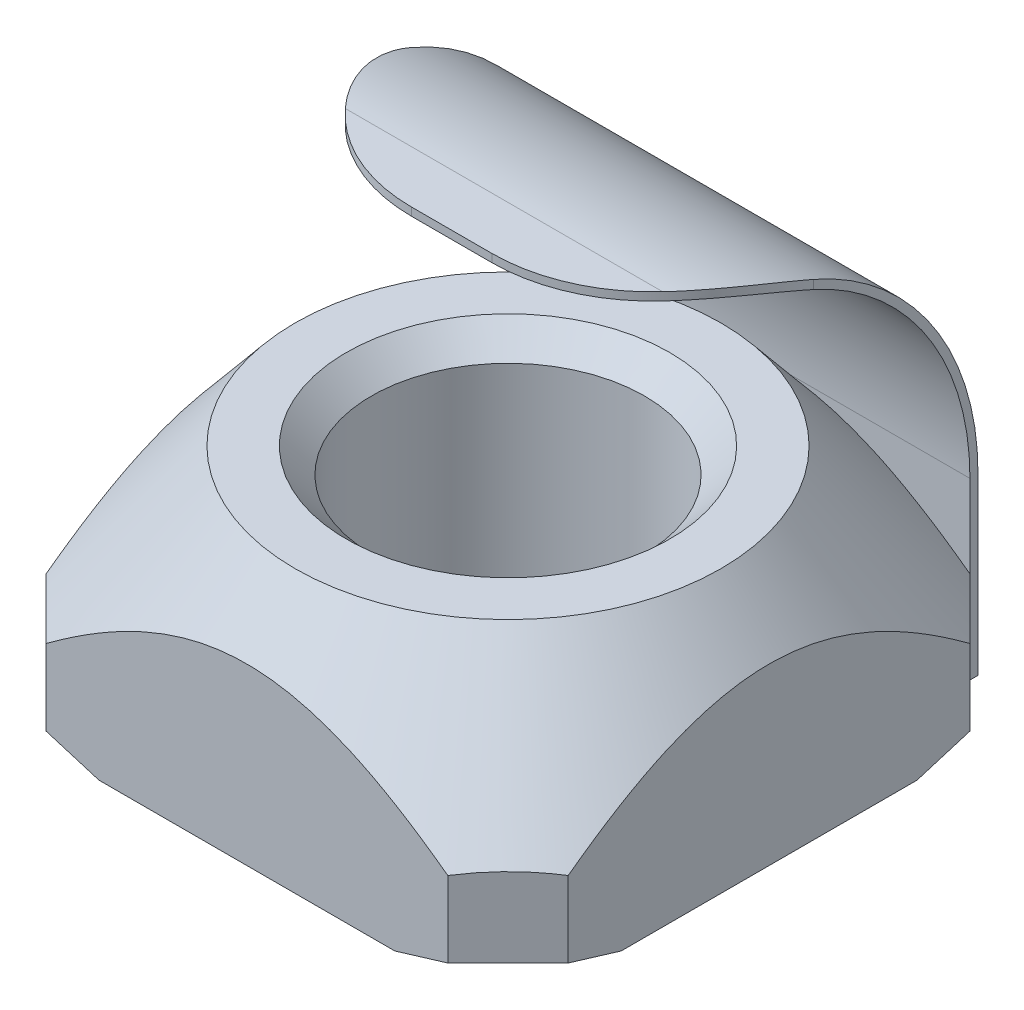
ISO-10303-21;
HEADER;
FILE_DESCRIPTION(('STEP AP214'),'2;1');
FILE_NAME('part.step','',(''),(''),'','','');
FILE_SCHEMA(('AUTOMOTIVE_DESIGN { 1 0 10303 214 1 1 1 1 }'));
ENDSEC;
DATA;
#1=APPLICATION_CONTEXT('core data for automotive mechanical design processes');
#2=APPLICATION_PROTOCOL_DEFINITION('international standard','automotive_design',2000,#1);
#3=PRODUCT_CONTEXT('',#1,'mechanical');
#4=PRODUCT('Part','Part','',(#3));
#5=PRODUCT_RELATED_PRODUCT_CATEGORY('part','',(#4));
#6=PRODUCT_DEFINITION_FORMATION('','',#4);
#7=PRODUCT_DEFINITION_CONTEXT('part definition',#1,'design');
#8=PRODUCT_DEFINITION('design','',#6,#7);
#9=PRODUCT_DEFINITION_SHAPE('','',#8);
#10=(LENGTH_UNIT() NAMED_UNIT(*) SI_UNIT(.MILLI.,.METRE.));
#11=(NAMED_UNIT(*) PLANE_ANGLE_UNIT() SI_UNIT($,.RADIAN.));
#12=(NAMED_UNIT(*) SI_UNIT($,.STERADIAN.) SOLID_ANGLE_UNIT());
#13=UNCERTAINTY_MEASURE_WITH_UNIT(LENGTH_MEASURE(1.E-05),#10,'distance_accuracy_value','');
#14=(GEOMETRIC_REPRESENTATION_CONTEXT(3) GLOBAL_UNCERTAINTY_ASSIGNED_CONTEXT((#13)) GLOBAL_UNIT_ASSIGNED_CONTEXT((#10,
#11,#12)) REPRESENTATION_CONTEXT('',''));
#15=CARTESIAN_POINT('',(0.,0.,0.));
#16=DIRECTION('',(0.,0.,1.));
#17=DIRECTION('',(1.,0.,0.));
#18=AXIS2_PLACEMENT_3D('',#15,#16,#17);
#19=CARTESIAN_POINT('',(0.,0.,-6.5));
#20=DIRECTION('',(0.,0.,1.));
#21=DIRECTION('',(1.,0.,0.));
#22=AXIS2_PLACEMENT_3D('',#19,#20,#21);
#23=PLANE('',#22);
#24=DIRECTION('',(0.,-1.,0.));
#25=VECTOR('',#24,1.);
#26=CARTESIAN_POINT('',(5.,0.,-6.5));
#27=LINE('',#26,#25);
#28=CARTESIAN_POINT('',(5.,4.34680934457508,-6.5));
#29=VERTEX_POINT('',#28);
#30=CARTESIAN_POINT('',(5.,2.28738420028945,-6.5));
#31=VERTEX_POINT('',#30);
#32=EDGE_CURVE('E244',#29,#31,#27,.T.);
#33=ORIENTED_EDGE('',*,*,#32,.F.);
#34=DIRECTION('',(1.,0.,0.));
#35=VECTOR('',#34,1.);
#36=CARTESIAN_POINT('',(0.,4.34680934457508,-6.5));
#37=LINE('',#36,#35);
#38=CARTESIAN_POINT('',(0.,4.34680934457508,-6.5));
#39=VERTEX_POINT('',#38);
#40=EDGE_CURVE('E807',#29,#39,#37,.F.);
#41=ORIENTED_EDGE('',*,*,#40,.T.);
#42=CARTESIAN_POINT('',(5.,2.28738420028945,-6.5));
#43=CARTESIAN_POINT('',(4.89368788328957,2.36587308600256,-6.5));
#44=CARTESIAN_POINT('',(4.78663225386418,2.44335343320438,-6.5));
#45=CARTESIAN_POINT('',(4.57085834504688,2.59600839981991,-6.5));
#46=CARTESIAN_POINT('',(4.46213973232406,2.67118254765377,-6.5));
#47=CARTESIAN_POINT('',(4.13250736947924,2.89329329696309,-6.5));
#48=CARTESIAN_POINT('',(3.90887509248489,3.03625250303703,-6.5));
#49=CARTESIAN_POINT('',(3.44568000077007,3.31266876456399,-6.5));
#50=CARTESIAN_POINT('',(3.20583507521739,3.44565754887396,-6.5));
#51=CARTESIAN_POINT('',(2.71620375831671,3.69144116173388,-6.5));
#52=CARTESIAN_POINT('',(2.46643171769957,3.80426393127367,-6.5));
#53=CARTESIAN_POINT('',(2.03403602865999,3.97290981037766,-6.5));
#54=CARTESIAN_POINT('',(1.85411467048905,4.03562973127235,-6.5));
#55=CARTESIAN_POINT('',(1.48953259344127,4.14560175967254,-6.5));
#56=CARTESIAN_POINT('',(1.30487197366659,4.1928541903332,-6.5));
#57=CARTESIAN_POINT('',(0.93446419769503,4.26890783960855,-6.5));
#58=CARTESIAN_POINT('',(0.748769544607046,4.29796110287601,-6.5));
#59=CARTESIAN_POINT('',(0.375378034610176,4.33690796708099,-6.5));
#60=CARTESIAN_POINT('',(0.187681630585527,4.34680581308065,-6.5));
#61=CARTESIAN_POINT('',(-0.16789095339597,4.34681250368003,-6.5));
#62=CARTESIAN_POINT('',(-0.335770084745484,4.33889800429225,-6.5));
#63=CARTESIAN_POINT('',(-0.67007787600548,4.30766802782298,-6.5));
#64=CARTESIAN_POINT('',(-0.836506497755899,4.28435214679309,-6.5));
#65=CARTESIAN_POINT('',(-1.1688761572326,4.22305736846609,-6.5));
#66=CARTESIAN_POINT('',(-1.33478188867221,4.18488935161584,-6.5));
#67=CARTESIAN_POINT('',(-1.66300327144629,4.09557971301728,-6.5));
#68=CARTESIAN_POINT('',(-1.82531904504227,4.04443853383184,-6.5));
#69=CARTESIAN_POINT('',(-2.26278520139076,3.88966748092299,-6.5));
#70=CARTESIAN_POINT('',(-2.53401026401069,3.77493770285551,-6.5));
#71=CARTESIAN_POINT('',(-3.06495183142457,3.52065441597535,-6.5));
#72=CARTESIAN_POINT('',(-3.3246418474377,3.38104712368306,-6.5));
#73=CARTESIAN_POINT('',(-3.70222068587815,3.16048573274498,-6.5));
#74=CARTESIAN_POINT('',(-3.82420098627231,3.08639312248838,-6.5));
#75=CARTESIAN_POINT('',(-4.06587782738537,2.93454605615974,-6.5));
#76=CARTESIAN_POINT('',(-4.18557421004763,2.85679134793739,-6.5));
#77=CARTESIAN_POINT('',(-4.42223945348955,2.6985571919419,-6.5));
#78=CARTESIAN_POINT('',(-4.53921928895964,2.61809408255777,-6.5));
#79=CARTESIAN_POINT('',(-4.77124208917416,2.45448404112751,-6.5));
#80=CARTESIAN_POINT('',(-4.88628556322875,2.37133783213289,-6.5));
#81=CARTESIAN_POINT('',(-5.00046680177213,2.28703952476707,-6.5));
#82=B_SPLINE_CURVE_WITH_KNOTS('',3,(#42,#43,#44,#45,#46,#47,#48,#49,#50,#51,#52,#53,#54,#55,#56,
#57,#58,#59,#60,#61,#62,#63,#64,#65,#66,#67,#68,#69,#70,#71,#72,#73,#74,#75,#76,#77,#78,#79,#80,
#81),.UNSPECIFIED.,.F.,.F.,(4,2,2,2,2,2,2,2,2,2,2,2,2,2,2,2,2,2,2,4),(0.,0.396428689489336,
0.792937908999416,1.58879123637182,2.41086642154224,3.23179359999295,3.80284462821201,
4.3738837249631,4.93682857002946,5.49964864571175,6.00312039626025,6.50660535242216,
7.0167230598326,7.52682336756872,8.40845898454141,9.29202428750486,9.72013309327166,
10.148271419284,10.574175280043,10.9999653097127),.UNSPECIFIED.);
#83=EDGE_CURVE('E754',#31,#39,#82,.T.);
#84=ORIENTED_EDGE('',*,*,#83,.F.);
#85=EDGE_LOOP('',(#33,#41,#84));
#86=FACE_BOUND('',#85,.T.);
#87=ADVANCED_FACE('F55',(#86),#23,.T.);
#88=CARTESIAN_POINT('',(-5.00007437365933,2.28721411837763,-6.50000000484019));
#89=VERTEX_POINT('',#88);
#90=EDGE_CURVE('E740',#39,#89,#82,.T.);
#91=ORIENTED_EDGE('',*,*,#90,.F.);
#92=DIRECTION('',(1.,0.,0.));
#93=VECTOR('',#92,1.);
#94=CARTESIAN_POINT('',(0.,4.34680934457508,-6.5));
#95=LINE('',#94,#93);
#96=CARTESIAN_POINT('',(-5.,4.34680934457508,-6.5));
#97=VERTEX_POINT('',#96);
#98=EDGE_CURVE('E806',#39,#97,#95,.F.);
#99=ORIENTED_EDGE('',*,*,#98,.T.);
#100=DIRECTION('',(0.,1.,0.));
#101=VECTOR('',#100,1.);
#102=CARTESIAN_POINT('',(-5.,11.1468093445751,-6.5));
#103=LINE('',#102,#101);
#104=EDGE_CURVE('E253',#89,#97,#103,.T.);
#105=ORIENTED_EDGE('',*,*,#104,.F.);
#106=EDGE_LOOP('',(#91,#99,#105));
#107=FACE_BOUND('',#106,.T.);
#108=ADVANCED_FACE('F519',(#107),#23,.T.);
#109=CARTESIAN_POINT('',(-6.5,5.8,-6.5));
#110=DIRECTION('',(0.,0.,1.));
#111=DIRECTION('',(1.,0.,0.));
#112=AXIS2_PLACEMENT_3D('',#109,#110,#111);
#113=PLANE('',#112);
#114=DIRECTION('',(0.,1.,0.));
#115=VECTOR('',#114,1.);
#116=CARTESIAN_POINT('',(5.00093362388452,37.1474583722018,-6.5));
#117=LINE('',#116,#115);
#118=CARTESIAN_POINT('',(5.00093362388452,0.399999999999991,-6.5));
#119=VERTEX_POINT('',#118);
#120=CARTESIAN_POINT('',(5.00093362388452,2.28669481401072,-6.5));
#121=VERTEX_POINT('',#120);
#122=EDGE_CURVE('E603',#119,#121,#117,.T.);
#123=ORIENTED_EDGE('',*,*,#122,.F.);
#124=DIRECTION('',(0.956938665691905,0.290290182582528,0.));
#125=VECTOR('',#124,1.);
#126=CARTESIAN_POINT('',(4.9724488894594,0.391359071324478,-6.5));
#127=LINE('',#126,#125);
#128=CARTESIAN_POINT('',(5.,0.399716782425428,-6.5));
#129=VERTEX_POINT('',#128);
#130=EDGE_CURVE('E598',#119,#129,#127,.F.);
#131=ORIENTED_EDGE('',*,*,#130,.T.);
#132=EDGE_CURVE('E248',#31,#129,#27,.T.);
#133=ORIENTED_EDGE('',*,*,#132,.F.);
#134=CARTESIAN_POINT('',(5.00093362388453,2.28669481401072,-6.5));
#135=CARTESIAN_POINT('',(5.0008947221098,2.28672353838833,-6.50000000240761));
#136=CARTESIAN_POINT('',(5.00085582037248,2.28675226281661,-6.50000000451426));
#137=CARTESIAN_POINT('',(5.00077801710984,2.28680971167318,-6.50000000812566));
#138=CARTESIAN_POINT('',(5.00073911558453,2.28683843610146,-6.5000000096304));
#139=CARTESIAN_POINT('',(5.00066131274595,2.28689588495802,-6.50000001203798));
#140=CARTESIAN_POINT('',(5.00062241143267,2.2869246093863,-6.50000001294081));
#141=CARTESIAN_POINT('',(5.00054460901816,2.28698205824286,-6.50000001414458));
#142=CARTESIAN_POINT('',(5.00050570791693,2.28701078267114,-6.50000001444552));
#143=CARTESIAN_POINT('',(5.0004279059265,2.2870682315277,-6.5000000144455));
#144=CARTESIAN_POINT('',(5.00038900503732,2.28709695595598,-6.50000001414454));
#145=CARTESIAN_POINT('',(5.000311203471,2.28715440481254,-6.50000001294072));
#146=CARTESIAN_POINT('',(5.00027230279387,2.28718312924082,-6.50000001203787));
#147=CARTESIAN_POINT('',(5.00019450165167,2.28724057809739,-6.50000000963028));
#148=CARTESIAN_POINT('',(5.00015560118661,2.28726930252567,-6.50000000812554));
#149=CARTESIAN_POINT('',(5.00007780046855,2.28732675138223,-6.50000000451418));
#150=CARTESIAN_POINT('',(5.00003890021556,2.28735547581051,-6.50000000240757));
#151=CARTESIAN_POINT('',(5.,2.28738420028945,-6.5));
#152=B_SPLINE_CURVE_WITH_KNOTS('',3,(#134,#135,#136,#137,#138,#139,#140,#141,#142,#143,#144,
#145,#146,#147,#148,#149,#150,#151),.UNSPECIFIED.,.F.,.F.,(4,2,2,2,2,2,2,2,4),(0.,
0.000145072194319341,0.000290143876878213,0.000435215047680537,0.000580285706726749,
0.000725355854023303,0.000870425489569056,0.00101549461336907,0.00116056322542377),.UNSPECIFIED.);
#153=EDGE_CURVE('E232',#121,#31,#152,.T.);
#154=ORIENTED_EDGE('',*,*,#153,.F.);
#155=EDGE_LOOP('',(#123,#131,#133,#154));
#156=FACE_BOUND('',#155,.T.);
#157=ADVANCED_FACE('F516',(#156),#113,.F.);
#158=CARTESIAN_POINT('',(0.,5.8,0.));
#159=DIRECTION('',(0.,-1.,0.));
#160=DIRECTION('',(0.,0.,-1.));
#161=AXIS2_PLACEMENT_3D('',#158,#159,#160);
#162=PLANE('',#161);
#163=CARTESIAN_POINT('',(0.,5.8,0.));
#164=DIRECTION('',(0.,-1.,0.));
#165=DIRECTION('',(0.,0.,-1.));
#166=AXIS2_PLACEMENT_3D('',#163,#164,#165);
#167=CIRCLE('',#166,4.02500000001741);
#168=CARTESIAN_POINT('',(0.,5.8,-4.02500000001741));
#169=VERTEX_POINT('',#168);
#170=EDGE_CURVE('E587',#169,#169,#167,.T.);
#171=ORIENTED_EDGE('',*,*,#170,.T.);
#172=EDGE_LOOP('',(#171));
#173=FACE_BOUND('',#172,.T.);
#174=CARTESIAN_POINT('',(0.,5.8,0.));
#175=DIRECTION('',(0.,-1.,0.));
#176=DIRECTION('',(0.,0.,-1.));
#177=AXIS2_PLACEMENT_3D('',#174,#175,#176);
#178=CIRCLE('',#177,5.3);
#179=CARTESIAN_POINT('',(0.,5.8,-5.3));
#180=VERTEX_POINT('',#179);
#181=EDGE_CURVE('E736',#180,#180,#178,.T.);
#182=ORIENTED_EDGE('',*,*,#181,.F.);
#183=EDGE_LOOP('',(#182));
#184=FACE_BOUND('',#183,.T.);
#185=ADVANCED_FACE('F288',(#173,#184),#162,.F.);
#186=CARTESIAN_POINT('',(5.00093362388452,37.1474583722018,-6.5));
#187=DIRECTION('',(0.707106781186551,0.,-0.707106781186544));
#188=DIRECTION('',(-0.707106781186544,0.,-0.707106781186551));
#189=AXIS2_PLACEMENT_3D('',#186,#187,#188);
#190=PLANE('',#189);
#191=DIRECTION('',(0.,1.,0.));
#192=VECTOR('',#191,1.);
#193=CARTESIAN_POINT('',(6.5,5.8,-5.00093362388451));
#194=LINE('',#193,#192);
#195=CARTESIAN_POINT('',(6.5000000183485,2.28669481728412,-5.00093359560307));
#196=VERTEX_POINT('',#195);
#197=CARTESIAN_POINT('',(6.5,0.399999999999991,-5.00093362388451));
#198=VERTEX_POINT('',#197);
#199=EDGE_CURVE('E729',#196,#198,#194,.F.);
#200=ORIENTED_EDGE('',*,*,#199,.T.);
#201=DIRECTION('',(-0.707106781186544,0.,-0.707106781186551));
#202=VECTOR('',#201,1.);
#203=CARTESIAN_POINT('',(5.00093362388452,0.399999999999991,-6.5));
#204=LINE('',#203,#202);
#205=EDGE_CURVE('E600',#198,#119,#204,.T.);
#206=ORIENTED_EDGE('',*,*,#205,.T.);
#207=ORIENTED_EDGE('',*,*,#122,.T.);
#208=CARTESIAN_POINT('',(6.50000003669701,2.28669480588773,-5.0009335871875));
#209=CARTESIAN_POINT('',(6.43784742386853,2.30045539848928,-5.06308620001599));
#210=CARTESIAN_POINT('',(6.37551621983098,2.3125664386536,-5.12541740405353));
#211=CARTESIAN_POINT('',(6.25056780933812,2.33340084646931,-5.25036581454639));
#212=CARTESIAN_POINT('',(6.18795058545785,2.34212400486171,-5.31298303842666));
#213=CARTESIAN_POINT('',(6.00058150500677,2.36298820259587,-5.50035211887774));
#214=CARTESIAN_POINT('',(5.87552418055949,2.36999999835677,-5.62540944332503));
#215=CARTESIAN_POINT('',(5.62540953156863,2.37000000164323,-5.87552409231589));
#216=CARTESIAN_POINT('',(5.50035220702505,2.36298820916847,-6.00058141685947));
#217=CARTESIAN_POINT('',(5.31298312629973,2.34212401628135,-6.1879504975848));
#218=CARTESIAN_POINT('',(5.25036590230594,2.33340085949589,-6.25056772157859));
#219=CARTESIAN_POINT('',(5.1254174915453,2.31256645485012,-6.37551613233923));
#220=CARTESIAN_POINT('',(5.0630862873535,2.30045541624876,-6.43784733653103));
#221=CARTESIAN_POINT('',(5.00093367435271,2.28669482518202,-6.49999994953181));
#222=B_SPLINE_CURVE_WITH_KNOTS('',3,(#208,#209,#210,#211,#212,#213,#214,#215,#216,#217,#218,
#219,#220,#221),.UNSPECIFIED.,.F.,.F.,(4,2,2,2,2,2,4),(0.,0.266874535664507,0.533765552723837,
1.06417199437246,1.59457843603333,1.86146945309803,2.12834398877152),.UNSPECIFIED.);
#223=EDGE_CURVE('E386',#196,#121,#222,.T.);
#224=ORIENTED_EDGE('',*,*,#223,.F.);
#225=EDGE_LOOP('',(#200,#206,#207,#224));
#226=FACE_BOUND('',#225,.T.);
#227=ADVANCED_FACE('F522',(#226),#190,.T.);
#228=CARTESIAN_POINT('',(-6.50000000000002,29.8974583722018,-5.0009336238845));
#229=DIRECTION('',(-0.707106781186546,0.,-0.707106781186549));
#230=DIRECTION('',(-0.707106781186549,0.,0.707106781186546));
#231=AXIS2_PLACEMENT_3D('',#228,#229,#230);
#232=PLANE('',#231);
#233=DIRECTION('',(0.,1.,0.));
#234=VECTOR('',#233,1.);
#235=CARTESIAN_POINT('',(-6.5,5.8,-5.00093362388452));
#236=LINE('',#235,#234);
#237=CARTESIAN_POINT('',(-6.5000000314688,0.429511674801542,-5.00093356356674));
#238=VERTEX_POINT('',#237);
#239=CARTESIAN_POINT('',(-6.4999999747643,2.28669481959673,-5.00093364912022));
#240=VERTEX_POINT('',#239);
#241=EDGE_CURVE('E321',#238,#240,#236,.T.);
#242=ORIENTED_EDGE('',*,*,#241,.T.);
#243=CARTESIAN_POINT('',(-5.00074302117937,2.28665261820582,-6.50019060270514));
#244=CARTESIAN_POINT('',(-5.06290327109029,2.30041834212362,-6.43803035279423));
#245=CARTESIAN_POINT('',(-5.12524219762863,2.31253414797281,-6.37569142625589));
#246=CARTESIAN_POINT('',(-5.25020620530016,2.33337729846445,-6.25072741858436));
#247=CARTESIAN_POINT('',(-5.31283130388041,2.34210443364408,-6.18810232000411));
#248=CARTESIAN_POINT('',(-5.50022389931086,2.36297922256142,-6.00070972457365));
#249=CARTESIAN_POINT('',(-5.62529704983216,2.36999640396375,-5.87563657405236));
#250=CARTESIAN_POINT('',(-5.87544356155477,2.37000359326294,-5.62549006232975));
#251=CARTESIAN_POINT('',(-6.0005169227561,2.36299360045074,-5.50041670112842));
#252=CARTESIAN_POINT('',(-6.18791011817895,2.34212941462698,-5.31302350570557));
#253=CARTESIAN_POINT('',(-6.2505354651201,2.33340579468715,-5.25039815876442));
#254=CARTESIAN_POINT('',(-6.37550005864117,2.31256957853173,-5.12543356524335));
#255=CARTESIAN_POINT('',(-6.43783932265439,2.30045719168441,-5.06309430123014));
#256=CARTESIAN_POINT('',(-6.49999994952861,2.28669482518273,-5.00093367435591));
#257=B_SPLINE_CURVE_WITH_KNOTS('',3,(#243,#244,#245,#246,#247,#248,#249,#250,#251,#252,#253,
#254,#255,#256),.UNSPECIFIED.,.F.,.F.,(4,2,2,2,2,2,4),(0.,0.266908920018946,0.533834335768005,
1.06430829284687,1.59478227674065,1.8617077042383,2.12861664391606),.UNSPECIFIED.);
#258=EDGE_CURVE('E786',#89,#240,#257,.T.);
#259=ORIENTED_EDGE('',*,*,#258,.F.);
#260=CARTESIAN_POINT('',(-5.,0.429311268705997,-6.5));
#261=DIRECTION('',(0.,1.,0.));
#262=VECTOR('',#261,1.);
#263=LINE('',#260,#262);
#264=CARTESIAN_POINT('',(-5.000101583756,0.429333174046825,-6.49999998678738));
#265=VERTEX_POINT('',#264);
#266=EDGE_CURVE('E263',#265,#89,#263,.T.);
#267=ORIENTED_EDGE('',*,*,#266,.F.);
#268=CARTESIAN_POINT('',(-6.50000006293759,0.429511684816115,-5.00093356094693));
#269=CARTESIAN_POINT('',(-6.37513912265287,0.419707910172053,-5.12579450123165));
#270=CARTESIAN_POINT('',(-6.2501816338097,0.412327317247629,-5.25075199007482));
#271=CARTESIAN_POINT('',(-6.00026695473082,0.402474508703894,-5.5006666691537));
#272=CARTESIAN_POINT('',(-5.87530983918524,0.399998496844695,-5.62562378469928));
#273=CARTESIAN_POINT('',(-5.6253956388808,0.400001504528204,-5.87553798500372));
#274=CARTESIAN_POINT('',(-5.50043855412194,0.40248052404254,-6.00049506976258));
#275=CARTESIAN_POINT('',(-5.25052399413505,0.412339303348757,-6.25040962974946));
#276=CARTESIAN_POINT('',(-5.12556659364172,0.419722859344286,-6.3753670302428));
#277=CARTESIAN_POINT('',(-5.00070576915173,0.429529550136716,-6.50022785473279));
#278=B_SPLINE_CURVE_WITH_KNOTS('',3,(#268,#269,#270,#271,#272,#273,#274,#275,#276,#277),
.UNSPECIFIED.,.F.,.F.,(4,2,2,2,4),(0.,0.530542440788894,1.06067407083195,1.59080569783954,
2.12134813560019),.UNSPECIFIED.);
#279=EDGE_CURVE('E707',#238,#265,#278,.T.);
#280=ORIENTED_EDGE('',*,*,#279,.F.);
#281=EDGE_LOOP('',(#242,#259,#267,#280));
#282=FACE_BOUND('',#281,.T.);
#283=ADVANCED_FACE('F339',(#282),#232,.T.);
#284=CARTESIAN_POINT('',(0.,2.26561498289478,0.));
#285=DIRECTION('',(0.,-1.,0.));
#286=DIRECTION('',(0.,0.,-1.));
#287=AXIS2_PLACEMENT_3D('',#284,#285,#286);
#288=CONICAL_SURFACE('',#287,8.218586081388,0.690257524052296);
#289=ORIENTED_EDGE('',*,*,#181,.T.);
#290=EDGE_LOOP('',(#289));
#291=FACE_BOUND('',#290,.T.);
#292=CARTESIAN_POINT('',(-6.5,2.28669479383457,-5.00093365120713));
#293=CARTESIAN_POINT('',(-6.5,2.36546799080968,-4.89424883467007));
#294=CARTESIAN_POINT('',(-6.5,2.44322583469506,-4.78681562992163));
#295=CARTESIAN_POINT('',(-6.5,2.59641962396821,-4.57027405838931));
#296=CARTESIAN_POINT('',(-6.5,2.67185507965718,-4.46116534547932));
#297=CARTESIAN_POINT('',(-6.5,2.89474506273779,-4.13030464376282));
#298=CARTESIAN_POINT('',(-6.5,3.03819049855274,-3.90581211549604));
#299=CARTESIAN_POINT('',(-6.5,3.3144839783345,-3.44244554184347));
#300=CARTESIAN_POINT('',(-6.5,3.446963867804,-3.20335000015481));
#301=CARTESIAN_POINT('',(-6.5,3.69182974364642,-2.71531189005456));
#302=CARTESIAN_POINT('',(-6.5,3.80424681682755,-2.46638529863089));
#303=CARTESIAN_POINT('',(-6.5,3.96403100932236,-2.05685554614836));
#304=CARTESIAN_POINT('',(-6.5,4.01970601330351,-1.89949403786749));
#305=CARTESIAN_POINT('',(-6.5,4.11943115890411,-1.58107563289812));
#306=CARTESIAN_POINT('',(-6.5,4.16348088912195,-1.42001860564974));
#307=CARTESIAN_POINT('',(-6.5,4.23795129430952,-1.09622089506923));
#308=CARTESIAN_POINT('',(-6.5,4.26848687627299,-0.93350693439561));
#309=CARTESIAN_POINT('',(-6.5,4.31512440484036,-0.606009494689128));
#310=CARTESIAN_POINT('',(-6.5,4.33122760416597,-0.4412261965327));
#311=CARTESIAN_POINT('',(-6.5,4.34827288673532,-0.109460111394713));
#312=CARTESIAN_POINT('',(-6.5,4.34908496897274,0.0575294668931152));
#313=CARTESIAN_POINT('',(-6.5,4.33517240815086,0.390853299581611));
#314=CARTESIAN_POINT('',(-6.5,4.32044739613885,0.557187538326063));
#315=CARTESIAN_POINT('',(-6.5,4.27612939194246,0.888465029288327));
#316=CARTESIAN_POINT('',(-6.5,4.24648158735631,1.05340085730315));
#317=CARTESIAN_POINT('',(-6.5,4.17365858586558,1.38023476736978));
#318=CARTESIAN_POINT('',(-6.5,4.13048144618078,1.54213240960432));
#319=CARTESIAN_POINT('',(-6.5,4.0093959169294,1.93682022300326));
#320=CARTESIAN_POINT('',(-6.5,3.92467683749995,2.16751986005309));
#321=CARTESIAN_POINT('',(-6.5,3.73511566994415,2.62049147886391));
#322=CARTESIAN_POINT('',(-6.5,3.63025898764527,2.84275720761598));
#323=CARTESIAN_POINT('',(-6.5,3.40489593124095,3.27955984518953));
#324=CARTESIAN_POINT('',(-6.5,3.28436490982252,3.49408388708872));
#325=CARTESIAN_POINT('',(-6.5,3.03143738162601,3.9158521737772));
#326=CARTESIAN_POINT('',(-6.5,2.89904496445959,4.1230988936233));
#327=CARTESIAN_POINT('',(-6.5,2.68538390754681,4.4414714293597));
#328=CARTESIAN_POINT('',(-6.5,2.60727223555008,4.55474074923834));
#329=CARTESIAN_POINT('',(-6.5,2.44869998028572,4.77925161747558));
#330=CARTESIAN_POINT('',(-6.5,2.368244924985,4.89049706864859));
#331=CARTESIAN_POINT('',(-6.5,2.16862829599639,5.16082132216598));
#332=CARTESIAN_POINT('',(-6.5,2.04826647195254,5.31901352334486));
#333=CARTESIAN_POINT('',(-6.5,1.80373098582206,5.63242892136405));
#334=CARTESIAN_POINT('',(-6.5,1.67955704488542,5.78765189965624));
#335=CARTESIAN_POINT('',(-6.5,1.30215867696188,6.24958490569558));
#336=CARTESIAN_POINT('',(-6.5,1.04417008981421,6.55240926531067));
#337=CARTESIAN_POINT('',(-6.5,0.64944222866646,7.00169242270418));
#338=CARTESIAN_POINT('',(-6.5,0.516079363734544,7.15115890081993));
#339=CARTESIAN_POINT('',(-6.5,0.247352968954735,7.44829234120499));
#340=CARTESIAN_POINT('',(-6.5,0.111989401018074,7.59595926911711));
#341=CARTESIAN_POINT('',(-6.5,-0.160275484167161,7.88950744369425));
#342=CARTESIAN_POINT('',(-6.5,-0.297174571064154,8.03539076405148));
#343=CARTESIAN_POINT('',(-6.5,-0.572460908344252,8.32573048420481));
#344=CARTESIAN_POINT('',(-6.5,-0.710848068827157,8.47018696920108));
#345=CARTESIAN_POINT('',(-6.5,-0.849876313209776,8.61402052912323));
#346=B_SPLINE_CURVE_WITH_KNOTS('',3,(#292,#293,#294,#295,#296,#297,#298,#299,#300,#301,#302,
#303,#304,#305,#306,#307,#308,#309,#310,#311,#312,#313,#314,#315,#316,#317,#318,#319,#320,#321,
#322,#323,#324,#325,#326,#327,#328,#329,#330,#331,#332,#333,#334,#335,#336,#337,#338,#339,#340,
#341,#342,#343,#344,#345),.UNSPECIFIED.,.F.,.F.,(4,2,2,2,2,2,2,2,2,2,2,2,2,2,2,2,2,2,2,2,2,2,2,
2,2,2,4),(0.,0.397834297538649,0.79575191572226,1.59455698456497,2.41393831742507,
3.23203880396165,3.73242986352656,4.23283862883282,4.72890673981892,5.22493178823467,
5.72517202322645,6.22542413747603,6.72752726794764,7.22970253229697,7.96569928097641,
8.70223144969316,9.43993611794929,10.1773874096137,10.5901317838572,11.0019708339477,
11.5982226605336,12.1945182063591,13.3876704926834,13.9886053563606,14.5895516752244,
15.18971596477,15.7898441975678),.UNSPECIFIED.);
#347=CARTESIAN_POINT('',(-6.5,2.28669481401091,5.00093362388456));
#348=VERTEX_POINT('',#347);
#349=EDGE_CURVE('E310',#240,#348,#346,.T.);
#350=ORIENTED_EDGE('',*,*,#349,.T.);
#351=CARTESIAN_POINT('',(-6.5,2.28669481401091,5.00093362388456));
#352=CARTESIAN_POINT('',(-6.43784738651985,2.30045540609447,5.06308623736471));
#353=CARTESIAN_POINT('',(-6.37551618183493,2.31256644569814,5.12541744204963));
#354=CARTESIAN_POINT('',(-6.25056777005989,2.33340085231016,5.25036585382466));
#355=CARTESIAN_POINT('',(-6.18795054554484,2.34212401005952,5.31298307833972));
#356=CARTESIAN_POINT('',(-6.00058146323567,2.36298820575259,5.50035216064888));
#357=CARTESIAN_POINT('',(-5.87552413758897,2.36999999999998,5.62540948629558));
#358=CARTESIAN_POINT('',(-5.62540948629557,2.36999999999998,5.87552413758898));
#359=CARTESIAN_POINT('',(-5.50035216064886,2.36298820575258,6.00058146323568));
#360=CARTESIAN_POINT('',(-5.31298307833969,2.34212401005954,6.18795054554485));
#361=CARTESIAN_POINT('',(-5.25036585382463,2.3334008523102,6.25056777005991));
#362=CARTESIAN_POINT('',(-5.1254174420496,2.31256644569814,6.37551618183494));
#363=CARTESIAN_POINT('',(-5.06308623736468,2.3004554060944,6.43784738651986));
#364=CARTESIAN_POINT('',(-5.00093362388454,2.28669481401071,6.5));
#365=B_SPLINE_CURVE_WITH_KNOTS('',3,(#351,#352,#353,#354,#355,#356,#357,#358,#359,#360,#361,
#362,#363,#364),.UNSPECIFIED.,.F.,.F.,(4,2,2,2,2,2,4),(0.,0.266874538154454,0.533765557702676,
1.06417200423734,1.59457845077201,1.86146947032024,2.1283440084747),.UNSPECIFIED.);
#366=CARTESIAN_POINT('',(-5.00093362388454,2.28669481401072,6.5));
#367=VERTEX_POINT('',#366);
#368=EDGE_CURVE('E421',#348,#367,#365,.T.);
#369=ORIENTED_EDGE('',*,*,#368,.T.);
#370=CARTESIAN_POINT('',(-8.61402052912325,-0.849876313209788,6.5));
#371=CARTESIAN_POINT('',(-8.47226231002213,-0.712853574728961,6.5));
#372=CARTESIAN_POINT('',(-8.32989874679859,-0.576453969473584,6.5));
#373=CARTESIAN_POINT('',(-8.04379175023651,-0.305100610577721,6.5));
#374=CARTESIAN_POINT('',(-7.90004827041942,-0.170146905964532,6.5));
#375=CARTESIAN_POINT('',(-7.61084855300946,0.0982665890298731,6.5));
#376=CARTESIAN_POINT('',(-7.46539046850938,0.231724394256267,6.5));
#377=CARTESIAN_POINT('',(-7.17273247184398,0.496712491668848,6.5));
#378=CARTESIAN_POINT('',(-7.02553255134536,0.628242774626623,6.5));
#379=CARTESIAN_POINT('',(-6.57444721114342,1.02526866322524,6.5));
#380=CARTESIAN_POINT('',(-6.26743023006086,1.28725550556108,6.5));
#381=CARTESIAN_POINT('',(-5.79899801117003,1.67043781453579,6.5));
#382=CARTESIAN_POINT('',(-5.6415668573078,1.79650919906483,6.5));
#383=CARTESIAN_POINT('',(-5.32365214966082,2.04473565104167,6.5));
#384=CARTESIAN_POINT('',(-5.16316873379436,2.16689089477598,6.5));
#385=CARTESIAN_POINT('',(-4.78373694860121,2.44708557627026,6.5));
#386=CARTESIAN_POINT('',(-4.56340066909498,2.6032620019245,6.5));
#387=CARTESIAN_POINT('',(-4.11532472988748,2.90454167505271,6.5));
#388=CARTESIAN_POINT('',(-3.88758709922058,3.04964792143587,6.5));
#389=CARTESIAN_POINT('',(-3.42424354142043,3.32469164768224,6.5));
#390=CARTESIAN_POINT('',(-3.18867386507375,3.45468911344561,6.5));
#391=CARTESIAN_POINT('',(-2.82809088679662,3.63505165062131,6.5));
#392=CARTESIAN_POINT('',(-2.7067225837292,3.69272115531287,6.5));
#393=CARTESIAN_POINT('',(-2.46142254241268,3.80246432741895,6.5));
#394=CARTESIAN_POINT('',(-2.33748992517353,3.85453603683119,6.5));
#395=CARTESIAN_POINT('',(-2.03567957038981,3.97229489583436,6.5));
#396=CARTESIAN_POINT('',(-1.85653757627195,4.03479882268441,6.5));
#397=CARTESIAN_POINT('',(-1.49366314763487,4.14445397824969,6.5));
#398=CARTESIAN_POINT('',(-1.3099332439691,4.1916134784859,6.5));
#399=CARTESIAN_POINT('',(-0.939507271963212,4.26806650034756,6.5));
#400=CARTESIAN_POINT('',(-0.752826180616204,4.29743141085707,6.5));
#401=CARTESIAN_POINT('',(-0.377424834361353,4.33679917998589,6.5));
#402=CARTESIAN_POINT('',(-0.188704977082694,4.34680574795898,6.5));
#403=CARTESIAN_POINT('',(0.168738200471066,4.34681256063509,6.5));
#404=CARTESIAN_POINT('',(0.337464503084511,4.33881763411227,6.5));
#405=CARTESIAN_POINT('',(0.673437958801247,4.30727503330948,6.5));
#406=CARTESIAN_POINT('',(0.840685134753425,4.28372759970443,6.5));
#407=CARTESIAN_POINT('',(1.17298389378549,4.22214874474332,6.5));
#408=CARTESIAN_POINT('',(1.33802723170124,4.18407339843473,6.5));
#409=CARTESIAN_POINT('',(1.66458561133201,4.09508099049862,6.5));
#410=CARTESIAN_POINT('',(1.82610016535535,4.04416216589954,6.5));
#411=CARTESIAN_POINT('',(2.2574106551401,3.89156896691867,6.5));
#412=CARTESIAN_POINT('',(2.52349043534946,3.77938079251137,6.5));
#413=CARTESIAN_POINT('',(3.04427039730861,3.53112224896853,6.5));
#414=CARTESIAN_POINT('',(3.29895826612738,3.39502678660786,6.5));
#415=CARTESIAN_POINT('',(3.79997108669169,3.104296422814,6.5));
#416=CARTESIAN_POINT('',(4.04621847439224,2.94952943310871,6.5));
#417=CARTESIAN_POINT('',(4.52983094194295,2.62702844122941,6.5));
#418=CARTESIAN_POINT('',(4.76719961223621,2.4592997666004,6.5));
#419=CARTESIAN_POINT('',(5.16366125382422,2.16652576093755,6.5));
#420=CARTESIAN_POINT('',(5.32462714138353,2.04399314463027,6.5));
#421=CARTESIAN_POINT('',(5.64348852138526,1.79498986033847,6.5));
#422=CARTESIAN_POINT('',(5.80138388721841,1.66851903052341,6.5));
#423=CARTESIAN_POINT('',(6.27118999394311,1.28411288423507,6.5));
#424=CARTESIAN_POINT('',(6.57909586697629,1.02127768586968,6.5));
#425=CARTESIAN_POINT('',(7.03056529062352,0.623763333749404,6.5));
#426=CARTESIAN_POINT('',(7.1772866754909,0.492620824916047,6.5));
#427=CARTESIAN_POINT('',(7.46900304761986,0.228420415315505,6.5));
#428=CARTESIAN_POINT('',(7.61399801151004,0.0953624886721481,6.5));
#429=CARTESIAN_POINT('',(7.90228304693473,-0.172240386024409,6.5));
#430=CARTESIAN_POINT('',(8.04557494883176,-0.306783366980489,6.5));
#431=CARTESIAN_POINT('',(8.33078523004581,-0.577303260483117,6.5));
#432=CARTESIAN_POINT('',(8.47270368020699,-0.713280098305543,6.5));
#433=CARTESIAN_POINT('',(8.61402049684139,-0.849876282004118,6.5));
#434=B_SPLINE_CURVE_WITH_KNOTS('',3,(#370,#371,#372,#373,#374,#375,#376,#377,#378,#379,#380,
#381,#382,#383,#384,#385,#386,#387,#388,#389,#390,#391,#392,#393,#394,#395,#396,#397,#398,#399,
#400,#401,#402,#403,#404,#405,#406,#407,#408,#409,#410,#411,#412,#413,#414,#415,#416,#417,#418,
#419,#420,#421,#422,#423,#424,#425,#426,#427,#428,#429,#430,#431,#432,#433),.UNSPECIFIED.,.F.,
.F.,(4,2,2,2,2,2,2,2,2,2,2,2,2,2,2,2,2,2,2,2,2,2,2,2,2,2,2,2,2,2,2,4),(0.,0.591470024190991,
1.18296004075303,1.7751592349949,2.36736126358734,3.57785996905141,4.18287909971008,
4.78787095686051,5.59782029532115,6.4075494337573,7.21394517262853,7.61694467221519,
8.02008467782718,8.58868243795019,9.15697318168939,9.72296867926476,10.2888557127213,
10.7948665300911,11.3008695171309,11.8084146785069,12.3160295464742,13.1805661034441,
14.0460155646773,14.9179925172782,15.7896129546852,16.3964426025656,17.0032972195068,
18.2174745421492,18.8078311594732,19.3981957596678,19.987854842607,20.5774833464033),.UNSPECIFIED.);
#435=CARTESIAN_POINT('',(5.00093362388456,2.2866948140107,6.5));
#436=VERTEX_POINT('',#435);
#437=EDGE_CURVE('E359',#367,#436,#434,.T.);
#438=ORIENTED_EDGE('',*,*,#437,.T.);
#439=CARTESIAN_POINT('',(5.00093362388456,2.2866948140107,6.5));
#440=CARTESIAN_POINT('',(5.0630862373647,2.30045540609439,6.43784738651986));
#441=CARTESIAN_POINT('',(5.12541744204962,2.31256644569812,6.37551618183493));
#442=CARTESIAN_POINT('',(5.25036585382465,2.33340085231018,6.2505677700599));
#443=CARTESIAN_POINT('',(5.31298307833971,2.34212401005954,6.18795054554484));
#444=CARTESIAN_POINT('',(5.50035216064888,2.36298820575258,6.00058146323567));
#445=CARTESIAN_POINT('',(5.62540948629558,2.36999999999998,5.87552413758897));
#446=CARTESIAN_POINT('',(5.87552413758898,2.36999999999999,5.62540948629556));
#447=CARTESIAN_POINT('',(6.00058146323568,2.36298820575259,5.50035216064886));
#448=CARTESIAN_POINT('',(6.18795054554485,2.34212401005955,5.31298307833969));
#449=CARTESIAN_POINT('',(6.25056777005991,2.3334008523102,5.25036585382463));
#450=CARTESIAN_POINT('',(6.37551618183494,2.31256644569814,5.1254174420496));
#451=CARTESIAN_POINT('',(6.43784738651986,2.30045540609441,5.06308623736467));
#452=CARTESIAN_POINT('',(6.5,2.28669481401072,5.00093362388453));
#453=B_SPLINE_CURVE_WITH_KNOTS('',3,(#439,#440,#441,#442,#443,#444,#445,#446,#447,#448,#449,
#450,#451,#452),.UNSPECIFIED.,.F.,.F.,(4,2,2,2,2,2,4),(0.,0.266874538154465,0.533765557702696,
1.06417200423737,1.59457845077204,1.86146947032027,2.12834400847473),.UNSPECIFIED.);
#454=CARTESIAN_POINT('',(6.5,2.28669481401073,5.00093362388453));
#455=VERTEX_POINT('',#454);
#456=EDGE_CURVE('E414',#436,#455,#453,.T.);
#457=ORIENTED_EDGE('',*,*,#456,.T.);
#458=CARTESIAN_POINT('',(6.5,-0.849876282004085,8.61402049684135));
#459=CARTESIAN_POINT('',(6.5,-0.712913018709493,8.47232382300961));
#460=CARTESIAN_POINT('',(6.5,-0.576572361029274,8.3300223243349));
#461=CARTESIAN_POINT('',(6.5,-0.305335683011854,8.04404086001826));
#462=CARTESIAN_POINT('',(6.5,-0.170439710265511,7.90036084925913));
#463=CARTESIAN_POINT('',(6.5,0.0978617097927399,7.61128768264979));
#464=CARTESIAN_POINT('',(6.5,0.231265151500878,7.46589266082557));
#465=CARTESIAN_POINT('',(6.5,0.496146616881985,7.17336240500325));
#466=CARTESIAN_POINT('',(6.5,0.62762462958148,7.02622716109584));
#467=CARTESIAN_POINT('',(6.5,1.02472082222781,6.57508548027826));
#468=CARTESIAN_POINT('',(6.5,1.28682639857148,6.26794376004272));
#469=CARTESIAN_POINT('',(6.5,1.67017814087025,5.79932093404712));
#470=CARTESIAN_POINT('',(6.5,1.79630377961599,5.64182669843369));
#471=CARTESIAN_POINT('',(6.5,2.04463571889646,5.32378338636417));
#472=CARTESIAN_POINT('',(6.5,2.16684220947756,5.1632344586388));
#473=CARTESIAN_POINT('',(6.5,2.44717114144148,4.78362135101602));
#474=CARTESIAN_POINT('',(6.5,2.6034274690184,4.56316829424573));
#475=CARTESIAN_POINT('',(6.5,2.90485486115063,4.11484521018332));
#476=CARTESIAN_POINT('',(6.5,3.05002939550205,3.88697753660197));
#477=CARTESIAN_POINT('',(6.5,3.32503373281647,3.42363423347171));
#478=CARTESIAN_POINT('',(6.5,3.45493731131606,3.18820282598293));
#479=CARTESIAN_POINT('',(6.5,3.69530337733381,2.70760975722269));
#480=CARTESIAN_POINT('',(6.5,3.80577999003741,2.46245532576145));
#481=CARTESIAN_POINT('',(6.5,3.96385037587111,2.05731877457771));
#482=CARTESIAN_POINT('',(6.5,4.01937425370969,1.90043160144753));
#483=CARTESIAN_POINT('',(6.5,4.11886471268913,1.583004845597));
#484=CARTESIAN_POINT('',(6.5,4.16283243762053,1.42246562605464));
#485=CARTESIAN_POINT('',(6.5,4.2374607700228,1.09871817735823));
#486=CARTESIAN_POINT('',(6.5,4.26815488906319,0.935517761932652));
#487=CARTESIAN_POINT('',(6.5,4.31502475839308,0.60702652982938));
#488=CARTESIAN_POINT('',(6.5,4.33120137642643,0.441735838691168));
#489=CARTESIAN_POINT('',(6.5,4.34827843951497,0.109352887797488));
#490=CARTESIAN_POINT('',(6.5,4.34908598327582,-0.0577442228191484));
#491=CARTESIAN_POINT('',(6.5,4.33514458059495,-0.391280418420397));
#492=CARTESIAN_POINT('',(6.5,4.32039536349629,-0.557719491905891));
#493=CARTESIAN_POINT('',(6.5,4.27603970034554,-0.888991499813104));
#494=CARTESIAN_POINT('',(6.5,4.2463973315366,-1.0538195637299));
#495=CARTESIAN_POINT('',(6.5,4.17360350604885,-1.38044128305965));
#496=CARTESIAN_POINT('',(6.5,4.13045012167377,-1.54223450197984));
#497=CARTESIAN_POINT('',(6.5,4.00942520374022,-1.93672477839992));
#498=CARTESIAN_POINT('',(6.5,3.92474578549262,-2.16733219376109));
#499=CARTESIAN_POINT('',(6.5,3.73527812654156,-2.62012622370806));
#500=CARTESIAN_POINT('',(6.5,3.63047530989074,-2.84230659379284));
#501=CARTESIAN_POINT('',(6.5,3.40513817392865,-3.27912165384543));
#502=CARTESIAN_POINT('',(6.5,3.28456664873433,-3.49373692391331));
#503=CARTESIAN_POINT('',(6.5,3.0315455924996,-3.91568226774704));
#504=CARTESIAN_POINT('',(6.5,2.89910007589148,-4.12301477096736));
#505=CARTESIAN_POINT('',(6.5,2.68529727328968,-4.44160164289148));
#506=CARTESIAN_POINT('',(6.5,2.60709625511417,-4.55499921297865));
#507=CARTESIAN_POINT('',(6.5,2.44851496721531,-4.7795042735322));
#508=CARTESIAN_POINT('',(6.5,2.3681459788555,-4.89061972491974));
#509=CARTESIAN_POINT('',(6.5,2.28669482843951,-5.00093360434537));
#510=B_SPLINE_CURVE_WITH_KNOTS('',3,(#458,#459,#460,#461,#462,#463,#464,#465,#466,#467,#468,
#469,#470,#471,#472,#473,#474,#475,#476,#477,#478,#479,#480,#481,#482,#483,#484,#485,#486,#487,
#488,#489,#490,#491,#492,#493,#494,#495,#496,#497,#498,#499,#500,#501,#502,#503,#504,#505,#506,
#507,#508,#509),.UNSPECIFIED.,.F.,.F.,(4,2,2,2,2,2,2,2,2,2,2,2,2,2,2,2,2,2,2,2,2,2,2,2,2,4),(0.,
0.591213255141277,1.18244592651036,1.77439547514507,2.36634839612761,3.57736231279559,
4.18263127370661,4.78787083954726,5.59825475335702,6.40838387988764,7.21442261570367,
8.01987284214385,8.51877387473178,9.01762550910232,9.51521024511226,10.0127652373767,
10.51332684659,11.0138971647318,11.5156807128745,12.0175358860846,12.7532333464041,
13.4894657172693,14.2274676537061,14.9652210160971,15.378434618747,15.7898043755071),.UNSPECIFIED.);
#511=EDGE_CURVE('E367',#455,#196,#510,.T.);
#512=ORIENTED_EDGE('',*,*,#511,.T.);
#513=ORIENTED_EDGE('',*,*,#223,.T.);
#514=ORIENTED_EDGE('',*,*,#153,.T.);
#515=ORIENTED_EDGE('',*,*,#83,.T.);
#516=ORIENTED_EDGE('',*,*,#90,.T.);
#517=ORIENTED_EDGE('',*,*,#258,.T.);
#518=EDGE_LOOP('',(#350,#369,#438,#457,#512,#513,#514,#515,#516,#517));
#519=FACE_BOUND('',#518,.T.);
#520=ADVANCED_FACE('F334',(#291,#519),#288,.T.);
#521=CARTESIAN_POINT('',(0.,0.432088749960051,0.));
#522=DIRECTION('',(0.,1.,0.));
#523=DIRECTION('',(0.,0.,1.));
#524=AXIS2_PLACEMENT_3D('',#521,#522,#523);
#525=CONICAL_SURFACE('',#524,8.207186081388,1.1655375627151);
#526=CARTESIAN_POINT('',(-3.0967725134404,0.,-6.5));
#527=CARTESIAN_POINT('',(-3.25677132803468,0.0295251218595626,-6.5));
#528=CARTESIAN_POINT('',(-3.41643066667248,0.0608477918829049,-6.5));
#529=CARTESIAN_POINT('',(-3.73502639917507,0.12672563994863,-6.5));
#530=CARTESIAN_POINT('',(-3.893963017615,0.161279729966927,-6.5));
#531=CARTESIAN_POINT('',(-4.21116679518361,0.233275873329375,-6.5));
#532=CARTESIAN_POINT('',(-4.36943399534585,0.27071774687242,-6.5));
#533=CARTESIAN_POINT('',(-4.6853903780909,0.348191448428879,-6.5));
#534=CARTESIAN_POINT('',(-4.84307934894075,0.388224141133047,-6.5));
#535=CARTESIAN_POINT('',(-5.00046686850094,0.429389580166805,-6.5));
#536=B_SPLINE_CURVE_WITH_KNOTS('',3,(#526,#527,#528,#529,#530,#531,#532,#533,#534,#535),
.UNSPECIFIED.,.F.,.F.,(4,2,2,2,4),(0.,0.488079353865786,0.975994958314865,1.46388020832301,
1.95192913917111),.UNSPECIFIED.);
#537=CARTESIAN_POINT('',(-3.0967725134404,0.,-6.5));
#538=VERTEX_POINT('',#537);
#539=EDGE_CURVE('E554',#538,#265,#536,.T.);
#540=ORIENTED_EDGE('',*,*,#539,.F.);
#541=CARTESIAN_POINT('',(0.,0.,0.));
#542=DIRECTION('',(0.,1.,0.));
#543=DIRECTION('',(0.,0.,1.));
#544=AXIS2_PLACEMENT_3D('',#541,#542,#543);
#545=CIRCLE('',#544,7.2);
#546=CARTESIAN_POINT('',(-6.5,0.,-3.0967725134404));
#547=VERTEX_POINT('',#546);
#548=EDGE_CURVE('E320',#547,#538,#545,.F.);
#549=ORIENTED_EDGE('',*,*,#548,.F.);
#550=CARTESIAN_POINT('',(-6.5,0.,-3.0967725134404));
#551=CARTESIAN_POINT('',(-6.5,0.0295324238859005,-3.25681088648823));
#552=CARTESIAN_POINT('',(-6.5,0.0608632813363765,-3.4165096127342));
#553=CARTESIAN_POINT('',(-6.5,0.126759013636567,-3.73518375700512));
#554=CARTESIAN_POINT('',(-6.5,0.161322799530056,-3.89415939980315));
#555=CARTESIAN_POINT('',(-6.5,0.233339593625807,-4.21144090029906));
#556=CARTESIAN_POINT('',(-6.5,0.270792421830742,-4.36974679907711));
#557=CARTESIAN_POINT('',(-6.5,0.3482890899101,-4.68578032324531));
#558=CARTESIAN_POINT('',(-6.5,0.388333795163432,-4.84350773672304));
#559=CARTESIAN_POINT('',(-6.5,0.429511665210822,-5.00093356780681));
#560=B_SPLINE_CURVE_WITH_KNOTS('',3,(#550,#551,#552,#553,#554,#555,#556,#557,#558,#559),
.UNSPECIFIED.,.F.,.F.,(4,2,2,2,4),(0.,0.488200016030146,0.976236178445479,1.46424195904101,
1.95241152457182),.UNSPECIFIED.);
#561=EDGE_CURVE('E323',#547,#238,#560,.T.);
#562=ORIENTED_EDGE('',*,*,#561,.T.);
#563=ORIENTED_EDGE('',*,*,#279,.T.);
#564=EDGE_LOOP('',(#540,#549,#562,#563));
#565=FACE_BOUND('',#564,.T.);
#566=ADVANCED_FACE('F338',(#565),#525,.T.);
#567=CARTESIAN_POINT('',(6.5,5.8,6.5));
#568=DIRECTION('',(-1.,0.,0.));
#569=DIRECTION('',(0.,0.,1.));
#570=AXIS2_PLACEMENT_3D('',#567,#568,#569);
#571=PLANE('',#570);
#572=DIRECTION('',(0.,0.,-1.));
#573=VECTOR('',#572,1.);
#574=CARTESIAN_POINT('',(6.5,0.,0.));
#575=LINE('',#574,#573);
#576=CARTESIAN_POINT('',(6.5,0.,-3.68233764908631));
#577=VERTEX_POINT('',#576);
#578=CARTESIAN_POINT('',(6.5,0.,3.68233764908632));
#579=VERTEX_POINT('',#578);
#580=EDGE_CURVE('E728',#577,#579,#575,.F.);
#581=ORIENTED_EDGE('',*,*,#580,.F.);
#582=DIRECTION('',(0.,-0.290290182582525,0.956938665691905));
#583=VECTOR('',#582,1.);
#584=CARTESIAN_POINT('',(6.5,0.391359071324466,-4.97244888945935));
#585=LINE('',#584,#583);
#586=EDGE_CURVE('E602',#577,#198,#585,.F.);
#587=ORIENTED_EDGE('',*,*,#586,.T.);
#588=ORIENTED_EDGE('',*,*,#199,.F.);
#589=ORIENTED_EDGE('',*,*,#511,.F.);
#590=DIRECTION('',(0.,-1.,0.));
#591=VECTOR('',#590,1.);
#592=CARTESIAN_POINT('',(6.5,5.8,5.00093362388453));
#593=LINE('',#592,#591);
#594=CARTESIAN_POINT('',(6.5,0.399999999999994,5.00093362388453));
#595=VERTEX_POINT('',#594);
#596=EDGE_CURVE('E829',#455,#595,#593,.T.);
#597=ORIENTED_EDGE('',*,*,#596,.T.);
#598=DIRECTION('',(0.,-0.290290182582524,-0.956938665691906));
#599=VECTOR('',#598,1.);
#600=CARTESIAN_POINT('',(6.5,0.39135907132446,4.97244888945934));
#601=LINE('',#600,#599);
#602=EDGE_CURVE('E837',#595,#579,#601,.T.);
#603=ORIENTED_EDGE('',*,*,#602,.T.);
#604=EDGE_LOOP('',(#581,#587,#588,#589,#597,#603));
#605=FACE_BOUND('',#604,.T.);
#606=ADVANCED_FACE('F640',(#605),#571,.F.);
#607=CARTESIAN_POINT('',(-6.5,5.8,6.5));
#608=DIRECTION('',(0.,0.,-1.));
#609=DIRECTION('',(-1.,0.,0.));
#610=AXIS2_PLACEMENT_3D('',#607,#608,#609);
#611=PLANE('',#610);
#612=DIRECTION('',(0.,-1.,0.));
#613=VECTOR('',#612,1.);
#614=CARTESIAN_POINT('',(-5.00093362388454,5.8,6.5));
#615=LINE('',#614,#613);
#616=CARTESIAN_POINT('',(-5.00093362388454,0.399999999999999,6.5));
#617=VERTEX_POINT('',#616);
#618=EDGE_CURVE('E823',#367,#617,#615,.T.);
#619=ORIENTED_EDGE('',*,*,#618,.T.);
#620=DIRECTION('',(0.956938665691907,-0.290290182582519,0.));
#621=VECTOR('',#620,1.);
#622=CARTESIAN_POINT('',(-4.97244888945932,0.39135907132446,6.5));
#623=LINE('',#622,#621);
#624=CARTESIAN_POINT('',(-3.68233764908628,0.,6.5));
#625=VERTEX_POINT('',#624);
#626=EDGE_CURVE('E578',#617,#625,#623,.T.);
#627=ORIENTED_EDGE('',*,*,#626,.T.);
#628=DIRECTION('',(1.,0.,0.));
#629=VECTOR('',#628,1.);
#630=CARTESIAN_POINT('',(0.,0.,6.5));
#631=LINE('',#630,#629);
#632=CARTESIAN_POINT('',(3.68233764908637,0.,6.5));
#633=VERTEX_POINT('',#632);
#634=EDGE_CURVE('E844',#633,#625,#631,.F.);
#635=ORIENTED_EDGE('',*,*,#634,.F.);
#636=DIRECTION('',(0.956938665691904,0.290290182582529,0.));
#637=VECTOR('',#636,1.);
#638=CARTESIAN_POINT('',(4.97244888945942,0.391359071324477,6.5));
#639=LINE('',#638,#637);
#640=CARTESIAN_POINT('',(5.00093362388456,0.399999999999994,6.5));
#641=VERTEX_POINT('',#640);
#642=EDGE_CURVE('E596',#633,#641,#639,.T.);
#643=ORIENTED_EDGE('',*,*,#642,.T.);
#644=DIRECTION('',(0.,1.,0.));
#645=VECTOR('',#644,1.);
#646=CARTESIAN_POINT('',(5.00093362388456,5.8,6.5));
#647=LINE('',#646,#645);
#648=EDGE_CURVE('E825',#641,#436,#647,.T.);
#649=ORIENTED_EDGE('',*,*,#648,.T.);
#650=ORIENTED_EDGE('',*,*,#437,.F.);
#651=EDGE_LOOP('',(#619,#627,#635,#643,#649,#650));
#652=FACE_BOUND('',#651,.T.);
#653=ADVANCED_FACE('F293',(#652),#611,.F.);
#654=CARTESIAN_POINT('',(-6.5,5.8,6.5));
#655=DIRECTION('',(1.,0.,0.));
#656=DIRECTION('',(0.,0.,-1.));
#657=AXIS2_PLACEMENT_3D('',#654,#655,#656);
#658=PLANE('',#657);
#659=DIRECTION('',(0.,0.,-1.));
#660=VECTOR('',#659,1.);
#661=CARTESIAN_POINT('',(-6.5,0.,0.));
#662=LINE('',#661,#660);
#663=CARTESIAN_POINT('',(-6.5,0.,3.68233764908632));
#664=VERTEX_POINT('',#663);
#665=EDGE_CURVE('E268',#664,#547,#662,.T.);
#666=ORIENTED_EDGE('',*,*,#665,.F.);
#667=DIRECTION('',(0.,0.290290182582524,0.956938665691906));
#668=VECTOR('',#667,1.);
#669=CARTESIAN_POINT('',(-6.5,0.391359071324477,4.97244888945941));
#670=LINE('',#669,#668);
#671=CARTESIAN_POINT('',(-6.5,0.399999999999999,5.00093362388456));
#672=VERTEX_POINT('',#671);
#673=EDGE_CURVE('E582',#664,#672,#670,.T.);
#674=ORIENTED_EDGE('',*,*,#673,.T.);
#675=DIRECTION('',(0.,1.,0.));
#676=VECTOR('',#675,1.);
#677=CARTESIAN_POINT('',(-6.5,5.8,5.00093362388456));
#678=LINE('',#677,#676);
#679=EDGE_CURVE('E422',#672,#348,#678,.T.);
#680=ORIENTED_EDGE('',*,*,#679,.T.);
#681=ORIENTED_EDGE('',*,*,#349,.F.);
#682=ORIENTED_EDGE('',*,*,#241,.F.);
#683=ORIENTED_EDGE('',*,*,#561,.F.);
#684=EDGE_LOOP('',(#666,#674,#680,#681,#682,#683));
#685=FACE_BOUND('',#684,.T.);
#686=ADVANCED_FACE('F289',(#685),#658,.F.);
#687=CARTESIAN_POINT('',(0.,0.,0.));
#688=DIRECTION('',(0.,-1.,0.));
#689=DIRECTION('',(0.,0.,-1.));
#690=AXIS2_PLACEMENT_3D('',#687,#688,#689);
#691=PLANE('',#690);
#692=CARTESIAN_POINT('',(0.,0.,0.));
#693=DIRECTION('',(0.,-1.,0.));
#694=DIRECTION('',(0.,0.,-1.));
#695=AXIS2_PLACEMENT_3D('',#692,#693,#694);
#696=CIRCLE('',#695,3.39999999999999);
#697=CARTESIAN_POINT('',(0.,0.,-3.39999999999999));
#698=VERTEX_POINT('',#697);
#699=EDGE_CURVE('E1077',#698,#698,#696,.T.);
#700=ORIENTED_EDGE('',*,*,#699,.F.);
#701=EDGE_LOOP('',(#700));
#702=FACE_BOUND('',#701,.T.);
#703=ORIENTED_EDGE('',*,*,#634,.T.);
#704=DIRECTION('',(-0.707106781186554,0.,-0.707106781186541));
#705=VECTOR('',#704,1.);
#706=CARTESIAN_POINT('',(-5.0911688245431,0.,5.09116882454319));
#707=LINE('',#706,#705);
#708=EDGE_CURVE('E584',#625,#664,#707,.T.);
#709=ORIENTED_EDGE('',*,*,#708,.T.);
#710=ORIENTED_EDGE('',*,*,#665,.T.);
#711=ORIENTED_EDGE('',*,*,#548,.T.);
#712=DIRECTION('',(-1.,0.,0.));
#713=VECTOR('',#712,1.);
#714=CARTESIAN_POINT('',(-5.,0.,-6.5));
#715=LINE('',#714,#713);
#716=CARTESIAN_POINT('',(-5.,0.,-6.5));
#717=VERTEX_POINT('',#716);
#718=EDGE_CURVE('E247',#538,#717,#715,.T.);
#719=ORIENTED_EDGE('',*,*,#718,.T.);
#720=DIRECTION('',(0.,0.,1.));
#721=VECTOR('',#720,1.);
#722=CARTESIAN_POINT('',(-5.,0.,-6.7));
#723=LINE('',#722,#721);
#724=CARTESIAN_POINT('',(-5.,0.,-6.7));
#725=VERTEX_POINT('',#724);
#726=EDGE_CURVE('E233',#725,#717,#723,.T.);
#727=ORIENTED_EDGE('',*,*,#726,.F.);
#728=DIRECTION('',(-1.,0.,0.));
#729=VECTOR('',#728,1.);
#730=CARTESIAN_POINT('',(-5.,0.,-6.7));
#731=LINE('',#730,#729);
#732=CARTESIAN_POINT('',(5.,0.,-6.7));
#733=VERTEX_POINT('',#732);
#734=EDGE_CURVE('E216',#733,#725,#731,.T.);
#735=ORIENTED_EDGE('',*,*,#734,.F.);
#736=DIRECTION('',(0.,0.,1.));
#737=VECTOR('',#736,1.);
#738=CARTESIAN_POINT('',(5.,0.,-6.7));
#739=LINE('',#738,#737);
#740=CARTESIAN_POINT('',(5.,0.,-5.18233764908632));
#741=VERTEX_POINT('',#740);
#742=EDGE_CURVE('E224',#733,#741,#739,.T.);
#743=ORIENTED_EDGE('',*,*,#742,.T.);
#744=DIRECTION('',(0.707106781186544,0.,0.707106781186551));
#745=VECTOR('',#744,1.);
#746=CARTESIAN_POINT('',(5.09116882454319,0.,-5.09116882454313));
#747=LINE('',#746,#745);
#748=EDGE_CURVE('E836',#741,#577,#747,.T.);
#749=ORIENTED_EDGE('',*,*,#748,.T.);
#750=ORIENTED_EDGE('',*,*,#580,.T.);
#751=DIRECTION('',(-0.707106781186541,0.,0.707106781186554));
#752=VECTOR('',#751,1.);
#753=CARTESIAN_POINT('',(5.09116882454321,0.,5.09116882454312));
#754=LINE('',#753,#752);
#755=EDGE_CURVE('E833',#579,#633,#754,.T.);
#756=ORIENTED_EDGE('',*,*,#755,.T.);
#757=EDGE_LOOP('',(#703,#709,#710,#711,#719,#727,#735,#743,#749,#750,#756));
#758=FACE_BOUND('',#757,.T.);
#759=ADVANCED_FACE('F236',(#702,#758),#691,.T.);
#760=CARTESIAN_POINT('',(5.,11.1468093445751,-6.7));
#761=DIRECTION('',(0.,-1.,0.));
#762=DIRECTION('',(0.,0.,-1.));
#763=AXIS2_PLACEMENT_3D('',#760,#761,#762);
#764=PLANE('',#763);
#765=CARTESIAN_POINT('',(1.,11.1468093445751,-2.6));
#766=DIRECTION('',(0.,-1.,0.));
#767=DIRECTION('',(0.,0.,-1.));
#768=AXIS2_PLACEMENT_3D('',#765,#766,#767);
#769=CIRCLE('',#768,4.);
#770=CARTESIAN_POINT('',(1.,11.1468093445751,1.4));
#771=VERTEX_POINT('',#770);
#772=CARTESIAN_POINT('',(3.95127091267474,11.1468093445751,0.0999999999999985));
#773=VERTEX_POINT('',#772);
#774=EDGE_CURVE('E487',#771,#773,#769,.F.);
#775=ORIENTED_EDGE('',*,*,#774,.T.);
#776=DIRECTION('',(1.,0.,0.));
#777=VECTOR('',#776,1.);
#778=CARTESIAN_POINT('',(5.,11.1468093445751,0.0999999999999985));
#779=LINE('',#778,#777);
#780=CARTESIAN_POINT('',(-3.95127091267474,11.1468093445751,0.0999999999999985));
#781=VERTEX_POINT('',#780);
#782=EDGE_CURVE('E78',#773,#781,#779,.F.);
#783=ORIENTED_EDGE('',*,*,#782,.T.);
#784=CARTESIAN_POINT('',(-1.,11.1468093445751,-2.6));
#785=DIRECTION('',(0.,-1.,0.));
#786=DIRECTION('',(0.,0.,-1.));
#787=AXIS2_PLACEMENT_3D('',#784,#785,#786);
#788=CIRCLE('',#787,4.);
#789=CARTESIAN_POINT('',(-1.,11.1468093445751,1.4));
#790=VERTEX_POINT('',#789);
#791=EDGE_CURVE('E485',#781,#790,#788,.F.);
#792=ORIENTED_EDGE('',*,*,#791,.T.);
#793=DIRECTION('',(-1.,0.,0.));
#794=VECTOR('',#793,1.);
#795=CARTESIAN_POINT('',(-5.,11.1468093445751,1.4));
#796=LINE('',#795,#794);
#797=EDGE_CURVE('E252',#771,#790,#796,.T.);
#798=ORIENTED_EDGE('',*,*,#797,.F.);
#799=EDGE_LOOP('',(#775,#783,#792,#798));
#800=FACE_BOUND('',#799,.T.);
#801=ADVANCED_FACE('F285',(#800),#764,.F.);
#802=CARTESIAN_POINT('',(5.,0.,-6.7));
#803=DIRECTION('',(-1.,0.,0.));
#804=DIRECTION('',(0.,0.,1.));
#805=AXIS2_PLACEMENT_3D('',#802,#803,#804);
#806=PLANE('',#805);
#807=DIRECTION('',(0.,-1.,0.));
#808=VECTOR('',#807,1.);
#809=CARTESIAN_POINT('',(5.,0.,-6.7));
#810=LINE('',#809,#808);
#811=CARTESIAN_POINT('',(5.,4.34680934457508,-6.7));
#812=VERTEX_POINT('',#811);
#813=EDGE_CURVE('E211',#812,#733,#810,.T.);
#814=ORIENTED_EDGE('',*,*,#813,.F.);
#815=CARTESIAN_POINT('',(5.,4.34680934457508,0.0999999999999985));
#816=DIRECTION('',(-1.,0.,0.));
#817=DIRECTION('',(0.,0.,1.));
#818=AXIS2_PLACEMENT_3D('',#815,#816,#817);
#819=CIRCLE('',#818,6.8);
#820=CARTESIAN_POINT('',(5.,10.5878028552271,-2.6));
#821=VERTEX_POINT('',#820);
#822=EDGE_CURVE('E480',#812,#821,#819,.F.);
#823=ORIENTED_EDGE('',*,*,#822,.T.);
#824=DIRECTION('',(0.,1.,0.));
#825=VECTOR('',#824,1.);
#826=CARTESIAN_POINT('',(5.,0.,-2.6));
#827=LINE('',#826,#825);
#828=CARTESIAN_POINT('',(5.,10.3692673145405,-2.6));
#829=VERTEX_POINT('',#828);
#830=EDGE_CURVE('E483',#821,#829,#827,.F.);
#831=ORIENTED_EDGE('',*,*,#830,.T.);
#832=CARTESIAN_POINT('',(5.,4.34680934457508,0.0999999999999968));
#833=DIRECTION('',(-1.,0.,0.));
#834=DIRECTION('',(0.,0.,1.));
#835=AXIS2_PLACEMENT_3D('',#832,#833,#834);
#836=CIRCLE('',#835,6.6);
#837=EDGE_CURVE('E811',#829,#29,#836,.T.);
#838=ORIENTED_EDGE('',*,*,#837,.T.);
#839=ORIENTED_EDGE('',*,*,#32,.T.);
#840=ORIENTED_EDGE('',*,*,#132,.T.);
#841=DIRECTION('',(0.,0.290290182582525,-0.956938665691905));
#842=VECTOR('',#841,1.);
#843=CARTESIAN_POINT('',(5.,0.421591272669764,-6.57210903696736));
#844=LINE('',#843,#842);
#845=EDGE_CURVE('E228',#129,#741,#844,.F.);
#846=ORIENTED_EDGE('',*,*,#845,.T.);
#847=ORIENTED_EDGE('',*,*,#742,.F.);
#848=EDGE_LOOP('',(#814,#823,#831,#838,#839,#840,#846,#847));
#849=FACE_BOUND('',#848,.T.);
#850=ADVANCED_FACE('F225',(#849),#806,.F.);
#851=CARTESIAN_POINT('',(-5.,11.1468093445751,-6.7));
#852=DIRECTION('',(1.,0.,0.));
#853=DIRECTION('',(0.,0.,-1.));
#854=AXIS2_PLACEMENT_3D('',#851,#852,#853);
#855=PLANE('',#854);
#856=DIRECTION('',(0.,-1.,0.));
#857=VECTOR('',#856,1.);
#858=CARTESIAN_POINT('',(-5.,11.1468093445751,-2.6));
#859=LINE('',#858,#857);
#860=CARTESIAN_POINT('',(-5.,10.3692673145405,-2.6));
#861=VERTEX_POINT('',#860);
#862=CARTESIAN_POINT('',(-5.,10.5878028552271,-2.6));
#863=VERTEX_POINT('',#862);
#864=EDGE_CURVE('E488',#861,#863,#859,.F.);
#865=ORIENTED_EDGE('',*,*,#864,.T.);
#866=CARTESIAN_POINT('',(-5.,4.34680934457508,0.0999999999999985));
#867=DIRECTION('',(1.,0.,0.));
#868=DIRECTION('',(0.,0.,-1.));
#869=AXIS2_PLACEMENT_3D('',#866,#867,#868);
#870=CIRCLE('',#869,6.8);
#871=CARTESIAN_POINT('',(-5.,4.34680934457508,-6.7));
#872=VERTEX_POINT('',#871);
#873=EDGE_CURVE('E13',#863,#872,#870,.F.);
#874=ORIENTED_EDGE('',*,*,#873,.T.);
#875=DIRECTION('',(0.,1.,0.));
#876=VECTOR('',#875,1.);
#877=CARTESIAN_POINT('',(-5.,11.1468093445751,-6.7));
#878=LINE('',#877,#876);
#879=EDGE_CURVE('E239',#725,#872,#878,.T.);
#880=ORIENTED_EDGE('',*,*,#879,.F.);
#881=ORIENTED_EDGE('',*,*,#726,.T.);
#882=EDGE_CURVE('E221',#717,#265,#103,.T.);
#883=ORIENTED_EDGE('',*,*,#882,.T.);
#884=ORIENTED_EDGE('',*,*,#266,.T.);
#885=ORIENTED_EDGE('',*,*,#104,.T.);
#886=CARTESIAN_POINT('',(-5.,4.34680934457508,0.0999999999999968));
#887=DIRECTION('',(1.,0.,0.));
#888=DIRECTION('',(0.,0.,-1.));
#889=AXIS2_PLACEMENT_3D('',#886,#887,#888);
#890=CIRCLE('',#889,6.6);
#891=EDGE_CURVE('E808',#97,#861,#890,.T.);
#892=ORIENTED_EDGE('',*,*,#891,.T.);
#893=EDGE_LOOP('',(#865,#874,#880,#881,#883,#884,#885,#892));
#894=FACE_BOUND('',#893,.T.);
#895=ADVANCED_FACE('F271',(#894),#855,.F.);
#896=CARTESIAN_POINT('',(0.,0.,-6.7));
#897=DIRECTION('',(0.,0.,1.));
#898=DIRECTION('',(1.,0.,0.));
#899=AXIS2_PLACEMENT_3D('',#896,#897,#898);
#900=PLANE('',#899);
#901=ORIENTED_EDGE('',*,*,#879,.T.);
#902=DIRECTION('',(1.,0.,0.));
#903=VECTOR('',#902,1.);
#904=CARTESIAN_POINT('',(0.,4.34680934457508,-6.7));
#905=LINE('',#904,#903);
#906=EDGE_CURVE('E219',#872,#812,#905,.T.);
#907=ORIENTED_EDGE('',*,*,#906,.T.);
#908=ORIENTED_EDGE('',*,*,#813,.T.);
#909=ORIENTED_EDGE('',*,*,#734,.T.);
#910=EDGE_LOOP('',(#901,#907,#908,#909));
#911=FACE_BOUND('',#910,.T.);
#912=ADVANCED_FACE('F214',(#911),#900,.F.);
#913=ORIENTED_EDGE('',*,*,#718,.F.);
#914=ORIENTED_EDGE('',*,*,#539,.T.);
#915=ORIENTED_EDGE('',*,*,#882,.F.);
#916=EDGE_LOOP('',(#913,#914,#915));
#917=FACE_BOUND('',#916,.T.);
#918=ADVANCED_FACE('F281',(#917),#23,.T.);
#919=CARTESIAN_POINT('',(5.,10.9468093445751,1.4));
#920=DIRECTION('',(0.,1.,0.));
#921=DIRECTION('',(0.,0.,1.));
#922=AXIS2_PLACEMENT_3D('',#919,#920,#921);
#923=PLANE('',#922);
#924=DIRECTION('',(1.,0.,0.));
#925=VECTOR('',#924,1.);
#926=CARTESIAN_POINT('',(5.,10.9468093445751,1.4));
#927=LINE('',#926,#925);
#928=CARTESIAN_POINT('',(-1.,10.9468093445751,1.4));
#929=VERTEX_POINT('',#928);
#930=CARTESIAN_POINT('',(1.,10.9468093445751,1.4));
#931=VERTEX_POINT('',#930);
#932=EDGE_CURVE('E1078',#929,#931,#927,.T.);
#933=ORIENTED_EDGE('',*,*,#932,.F.);
#934=CARTESIAN_POINT('',(-1.,10.9468093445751,-2.6));
#935=DIRECTION('',(0.,1.,0.));
#936=DIRECTION('',(0.,0.,1.));
#937=AXIS2_PLACEMENT_3D('',#934,#935,#936);
#938=CIRCLE('',#937,4.);
#939=CARTESIAN_POINT('',(-3.95127091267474,10.9468093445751,0.0999999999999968));
#940=VERTEX_POINT('',#939);
#941=EDGE_CURVE('E496',#929,#940,#938,.F.);
#942=ORIENTED_EDGE('',*,*,#941,.T.);
#943=DIRECTION('',(1.,0.,0.));
#944=VECTOR('',#943,1.);
#945=CARTESIAN_POINT('',(5.,10.9468093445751,0.0999999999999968));
#946=LINE('',#945,#944);
#947=CARTESIAN_POINT('',(3.95127091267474,10.9468093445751,0.0999999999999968));
#948=VERTEX_POINT('',#947);
#949=EDGE_CURVE('E809',#940,#948,#946,.T.);
#950=ORIENTED_EDGE('',*,*,#949,.T.);
#951=CARTESIAN_POINT('',(1.,10.9468093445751,-2.6));
#952=DIRECTION('',(0.,1.,0.));
#953=DIRECTION('',(0.,0.,1.));
#954=AXIS2_PLACEMENT_3D('',#951,#952,#953);
#955=CIRCLE('',#954,4.);
#956=EDGE_CURVE('E500',#948,#931,#955,.F.);
#957=ORIENTED_EDGE('',*,*,#956,.T.);
#958=EDGE_LOOP('',(#933,#942,#950,#957));
#959=FACE_BOUND('',#958,.T.);
#960=ADVANCED_FACE('F541',(#959),#923,.F.);
#961=CARTESIAN_POINT('',(0.,0.,1.4));
#962=DIRECTION('',(0.,0.,-1.));
#963=DIRECTION('',(-1.,0.,0.));
#964=AXIS2_PLACEMENT_3D('',#961,#962,#963);
#965=PLANE('',#964);
#966=ORIENTED_EDGE('',*,*,#797,.T.);
#967=DIRECTION('',(0.,-1.,0.));
#968=VECTOR('',#967,1.);
#969=CARTESIAN_POINT('',(-1.,0.,1.4));
#970=LINE('',#969,#968);
#971=EDGE_CURVE('E573',#790,#929,#970,.T.);
#972=ORIENTED_EDGE('',*,*,#971,.T.);
#973=ORIENTED_EDGE('',*,*,#932,.T.);
#974=DIRECTION('',(0.,1.,0.));
#975=VECTOR('',#974,1.);
#976=CARTESIAN_POINT('',(1.,0.,1.4));
#977=LINE('',#976,#975);
#978=EDGE_CURVE('E570',#931,#771,#977,.T.);
#979=ORIENTED_EDGE('',*,*,#978,.T.);
#980=EDGE_LOOP('',(#966,#972,#973,#979));
#981=FACE_BOUND('',#980,.T.);
#982=ADVANCED_FACE('F547',(#981),#965,.F.);
#983=CARTESIAN_POINT('',(0.,5.8,0.));
#984=DIRECTION('',(0.,1.,0.));
#985=DIRECTION('',(0.,0.,1.));
#986=AXIS2_PLACEMENT_3D('',#983,#984,#985);
#987=CYLINDRICAL_SURFACE('',#986,3.39999999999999);
#988=CARTESIAN_POINT('',(0.,5.17500000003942,0.));
#989=DIRECTION('',(0.,-1.,0.));
#990=DIRECTION('',(0.,0.,-1.));
#991=AXIS2_PLACEMENT_3D('',#988,#989,#990);
#992=CIRCLE('',#991,3.39999999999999);
#993=CARTESIAN_POINT('',(0.,5.17500000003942,-3.39999999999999));
#994=VERTEX_POINT('',#993);
#995=EDGE_CURVE('E590',#994,#994,#992,.F.);
#996=ORIENTED_EDGE('',*,*,#995,.T.);
#997=EDGE_LOOP('',(#996));
#998=FACE_BOUND('',#997,.T.);
#999=ORIENTED_EDGE('',*,*,#699,.T.);
#1000=EDGE_LOOP('',(#999));
#1001=FACE_BOUND('',#1000,.T.);
#1002=ADVANCED_FACE('F511',(#998,#1001),#987,.F.);
#1003=CARTESIAN_POINT('',(5.,4.34680934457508,0.0999999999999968));
#1004=DIRECTION('',(1.,0.,0.));
#1005=DIRECTION('',(0.,0.,-1.));
#1006=AXIS2_PLACEMENT_3D('',#1003,#1004,#1005);
#1007=CYLINDRICAL_SURFACE('',#1006,6.6);
#1008=ORIENTED_EDGE('',*,*,#949,.F.);
#1009=CARTESIAN_POINT('',(-3.95127091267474,10.9468093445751,0.0999999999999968));
#1010=CARTESIAN_POINT('',(-4.01978450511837,10.9468161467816,0.0251315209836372));
#1011=CARTESIAN_POINT('',(-4.08543683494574,10.9455357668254,-0.0523729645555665));
#1012=CARTESIAN_POINT('',(-4.21063644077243,10.9399087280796,-0.212096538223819));
#1013=CARTESIAN_POINT('',(-4.2701818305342,10.9355611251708,-0.294317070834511));
#1014=CARTESIAN_POINT('',(-4.382690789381,10.9233127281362,-0.462791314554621));
#1015=CARTESIAN_POINT('',(-4.43566033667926,10.9154151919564,-0.549041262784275));
#1016=CARTESIAN_POINT('',(-4.53473601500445,10.8956484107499,-0.724946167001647));
#1017=CARTESIAN_POINT('',(-4.58084320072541,10.8837797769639,-0.814600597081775));
#1018=CARTESIAN_POINT('',(-4.66606115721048,10.8556862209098,-0.996833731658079));
#1019=CARTESIAN_POINT('',(-4.70515169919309,10.839449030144,-1.08942001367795));
#1020=CARTESIAN_POINT('',(-4.77600805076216,10.8023846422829,-1.27645775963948));
#1021=CARTESIAN_POINT('',(-4.80777390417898,10.7815574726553,-1.37090921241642));
#1022=CARTESIAN_POINT('',(-4.86389846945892,10.7351970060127,-1.56073389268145));
#1023=CARTESIAN_POINT('',(-4.88826507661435,10.7096687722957,-1.65610602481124));
#1024=CARTESIAN_POINT('',(-4.92970037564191,10.6538723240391,-1.84700971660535));
#1025=CARTESIAN_POINT('',(-4.94677150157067,10.6236056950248,-1.94254121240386));
#1026=CARTESIAN_POINT('',(-4.97375143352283,10.5585358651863,-2.13259583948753));
#1027=CARTESIAN_POINT('',(-4.98369045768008,10.5237525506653,-2.22712153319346));
#1028=CARTESIAN_POINT('',(-4.99681710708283,10.4497768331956,-2.41475756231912));
#1029=CARTESIAN_POINT('',(-5.00001417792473,10.4105906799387,-2.50786969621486));
#1030=CARTESIAN_POINT('',(-5.,10.3692673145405,-2.6));
#1031=B_SPLINE_CURVE_WITH_KNOTS('',3,(#1009,#1010,#1011,#1012,#1013,#1014,#1015,#1016,#1017,
#1018,#1019,#1020,#1021,#1022,#1023,#1024,#1025,#1026,#1027,#1028,#1029,#1030),.UNSPECIFIED.,
.F.,.F.,(4,2,2,2,2,2,2,2,2,2,4),(0.,0.304396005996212,0.608885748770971,0.913096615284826,
1.2172606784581,1.52228802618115,1.82731354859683,2.13201244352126,2.4366095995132,
2.73990845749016,3.0427821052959),.UNSPECIFIED.);
#1032=EDGE_CURVE('E461',#940,#861,#1031,.T.);
#1033=ORIENTED_EDGE('',*,*,#1032,.T.);
#1034=ORIENTED_EDGE('',*,*,#891,.F.);
#1035=ORIENTED_EDGE('',*,*,#98,.F.);
#1036=ORIENTED_EDGE('',*,*,#40,.F.);
#1037=ORIENTED_EDGE('',*,*,#837,.F.);
#1038=CARTESIAN_POINT('',(5.,10.3692673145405,-2.6));
#1039=CARTESIAN_POINT('',(5.00001450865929,10.4107998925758,-2.50740396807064));
#1040=CARTESIAN_POINT('',(4.99678484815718,10.4501733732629,-2.41381566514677));
#1041=CARTESIAN_POINT('',(4.98352989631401,10.5244401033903,-2.22531307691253));
#1042=CARTESIAN_POINT('',(4.97350198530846,10.5593316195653,-2.13039829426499));
#1043=CARTESIAN_POINT('',(4.94635919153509,10.6244006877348,-1.94008900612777));
#1044=CARTESIAN_POINT('',(4.92925290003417,10.6545838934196,-1.84469522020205));
#1045=CARTESIAN_POINT('',(4.88777833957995,10.7102127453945,-1.65412207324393));
#1046=CARTESIAN_POINT('',(4.86341141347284,10.7356592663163,-1.55894267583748));
#1047=CARTESIAN_POINT('',(4.80726124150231,10.7819198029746,-1.36932206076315));
#1048=CARTESIAN_POINT('',(4.77545599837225,10.8027197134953,-1.27488390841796));
#1049=CARTESIAN_POINT('',(4.70452228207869,10.8397311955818,-1.08787713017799));
#1050=CARTESIAN_POINT('',(4.66539375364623,10.8559427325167,-0.995308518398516));
#1051=CARTESIAN_POINT('',(4.58002319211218,10.8840130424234,-0.812946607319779));
#1052=CARTESIAN_POINT('',(4.53378823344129,10.8958761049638,-0.723150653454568));
#1053=CARTESIAN_POINT('',(4.43445907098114,10.9156154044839,-0.547023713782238));
#1054=CARTESIAN_POINT('',(4.38136720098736,10.9234929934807,-0.460691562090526));
#1055=CARTESIAN_POINT('',(4.26888245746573,10.9356656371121,-0.292491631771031));
#1056=CARTESIAN_POINT('',(4.20951627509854,10.9399752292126,-0.210607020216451));
#1057=CARTESIAN_POINT('',(4.08479549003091,10.9455481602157,-0.0516162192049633));
#1058=CARTESIAN_POINT('',(4.01944986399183,10.9468159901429,0.0254968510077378));
#1059=CARTESIAN_POINT('',(3.95127091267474,10.9468093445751,0.0999999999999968));
#1060=B_SPLINE_CURVE_WITH_KNOTS('',3,(#1038,#1039,#1040,#1041,#1042,#1043,#1044,#1045,#1046,
#1047,#1048,#1049,#1050,#1051,#1052,#1053,#1054,#1055,#1056,#1057,#1058,#1059),.UNSPECIFIED.,
.F.,.F.,(4,2,2,2,2,2,2,2,2,2,4),(0.,0.30440502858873,0.60892742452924,0.913081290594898,
1.21717893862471,1.52218752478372,1.82719841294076,2.13190760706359,2.43651336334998,
2.73987183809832,3.04278214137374),.UNSPECIFIED.);
#1061=EDGE_CURVE('E491',#829,#948,#1060,.T.);
#1062=ORIENTED_EDGE('',*,*,#1061,.T.);
#1063=EDGE_LOOP('',(#1008,#1033,#1034,#1035,#1036,#1037,#1062));
#1064=FACE_BOUND('',#1063,.T.);
#1065=ADVANCED_FACE('F507',(#1064),#1007,.F.);
#1066=CARTESIAN_POINT('',(-6.5,5.8,5.00093362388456));
#1067=DIRECTION('',(0.707106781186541,0.,-0.707106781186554));
#1068=DIRECTION('',(0.,1.,0.));
#1069=AXIS2_PLACEMENT_3D('',#1066,#1067,#1068);
#1070=PLANE('',#1069);
#1071=ORIENTED_EDGE('',*,*,#679,.F.);
#1072=DIRECTION('',(-0.707106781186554,0.,-0.707106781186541));
#1073=VECTOR('',#1072,1.);
#1074=CARTESIAN_POINT('',(-6.5,0.399999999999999,5.00093362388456));
#1075=LINE('',#1074,#1073);
#1076=EDGE_CURVE('E580',#672,#617,#1075,.F.);
#1077=ORIENTED_EDGE('',*,*,#1076,.T.);
#1078=ORIENTED_EDGE('',*,*,#618,.F.);
#1079=ORIENTED_EDGE('',*,*,#368,.F.);
#1080=EDGE_LOOP('',(#1071,#1077,#1078,#1079));
#1081=FACE_BOUND('',#1080,.T.);
#1082=ADVANCED_FACE('F435',(#1081),#1070,.F.);
#1083=CARTESIAN_POINT('',(5.00093362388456,5.8,6.5));
#1084=DIRECTION('',(-0.707106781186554,0.,-0.707106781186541));
#1085=DIRECTION('',(0.,1.,0.));
#1086=AXIS2_PLACEMENT_3D('',#1083,#1084,#1085);
#1087=PLANE('',#1086);
#1088=ORIENTED_EDGE('',*,*,#648,.F.);
#1089=DIRECTION('',(-0.707106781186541,0.,0.707106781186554));
#1090=VECTOR('',#1089,1.);
#1091=CARTESIAN_POINT('',(5.00093362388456,0.399999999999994,6.5));
#1092=LINE('',#1091,#1090);
#1093=EDGE_CURVE('E594',#641,#595,#1092,.F.);
#1094=ORIENTED_EDGE('',*,*,#1093,.T.);
#1095=ORIENTED_EDGE('',*,*,#596,.F.);
#1096=ORIENTED_EDGE('',*,*,#456,.F.);
#1097=EDGE_LOOP('',(#1088,#1094,#1095,#1096));
#1098=FACE_BOUND('',#1097,.T.);
#1099=ADVANCED_FACE('F430',(#1098),#1087,.F.);
#1100=CARTESIAN_POINT('',(5.09116882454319,0.,-5.09116882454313));
#1101=DIRECTION('',(-0.278781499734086,0.919000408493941,0.278781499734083));
#1102=DIRECTION('',(0.707106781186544,0.,0.707106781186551));
#1103=AXIS2_PLACEMENT_3D('',#1100,#1101,#1102);
#1104=PLANE('',#1103);
#1105=ORIENTED_EDGE('',*,*,#130,.F.);
#1106=ORIENTED_EDGE('',*,*,#205,.F.);
#1107=ORIENTED_EDGE('',*,*,#586,.F.);
#1108=ORIENTED_EDGE('',*,*,#748,.F.);
#1109=ORIENTED_EDGE('',*,*,#845,.F.);
#1110=EDGE_LOOP('',(#1105,#1106,#1107,#1108,#1109));
#1111=FACE_BOUND('',#1110,.T.);
#1112=ADVANCED_FACE('F434',(#1111),#1104,.F.);
#1113=CARTESIAN_POINT('',(5.09116882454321,0.,5.09116882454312));
#1114=DIRECTION('',(0.278781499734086,-0.919000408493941,0.278781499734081));
#1115=DIRECTION('',(0.707106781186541,0.,-0.707106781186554));
#1116=AXIS2_PLACEMENT_3D('',#1113,#1114,#1115);
#1117=PLANE('',#1116);
#1118=ORIENTED_EDGE('',*,*,#602,.F.);
#1119=ORIENTED_EDGE('',*,*,#1093,.F.);
#1120=ORIENTED_EDGE('',*,*,#642,.F.);
#1121=ORIENTED_EDGE('',*,*,#755,.F.);
#1122=EDGE_LOOP('',(#1118,#1119,#1120,#1121));
#1123=FACE_BOUND('',#1122,.T.);
#1124=ADVANCED_FACE('F441',(#1123),#1117,.T.);
#1125=CARTESIAN_POINT('',(0.,5.17500000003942,0.));
#1126=DIRECTION('',(0.,1.,0.));
#1127=DIRECTION('',(0.,0.,1.));
#1128=AXIS2_PLACEMENT_3D('',#1125,#1126,#1127);
#1129=CONICAL_SURFACE('',#1128,3.39999999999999,0.785398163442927);
#1130=ORIENTED_EDGE('',*,*,#170,.F.);
#1131=EDGE_LOOP('',(#1130));
#1132=FACE_BOUND('',#1131,.T.);
#1133=ORIENTED_EDGE('',*,*,#995,.F.);
#1134=EDGE_LOOP('',(#1133));
#1135=FACE_BOUND('',#1134,.T.);
#1136=ADVANCED_FACE('F445',(#1132,#1135),#1129,.F.);
#1137=CARTESIAN_POINT('',(-5.0911688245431,0.,5.09116882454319));
#1138=DIRECTION('',(-0.278781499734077,-0.919000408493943,0.278781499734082));
#1139=DIRECTION('',(0.707106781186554,0.,0.707106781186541));
#1140=AXIS2_PLACEMENT_3D('',#1137,#1138,#1139);
#1141=PLANE('',#1140);
#1142=ORIENTED_EDGE('',*,*,#626,.F.);
#1143=ORIENTED_EDGE('',*,*,#1076,.F.);
#1144=ORIENTED_EDGE('',*,*,#673,.F.);
#1145=ORIENTED_EDGE('',*,*,#708,.F.);
#1146=EDGE_LOOP('',(#1142,#1143,#1144,#1145));
#1147=FACE_BOUND('',#1146,.T.);
#1148=ADVANCED_FACE('F449',(#1147),#1141,.T.);
#1149=CARTESIAN_POINT('',(-1.,0.,-2.6));
#1150=DIRECTION('',(0.,-1.,0.));
#1151=DIRECTION('',(0.,0.,-1.));
#1152=AXIS2_PLACEMENT_3D('',#1149,#1150,#1151);
#1153=CYLINDRICAL_SURFACE('',#1152,4.);
#1154=ORIENTED_EDGE('',*,*,#791,.F.);
#1155=CARTESIAN_POINT('',(-3.95127091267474,11.1468093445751,0.0999999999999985));
#1156=CARTESIAN_POINT('',(-4.02015598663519,11.1468160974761,0.0247253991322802));
#1157=CARTESIAN_POINT('',(-4.08614847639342,11.1455597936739,-0.0532130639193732));
#1158=CARTESIAN_POINT('',(-4.21196159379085,11.1400361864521,-0.213855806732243));
#1159=CARTESIAN_POINT('',(-4.27178040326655,11.1357679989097,-0.296561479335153));
#1160=CARTESIAN_POINT('',(-4.38477186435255,11.1237401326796,-0.466061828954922));
#1161=CARTESIAN_POINT('',(-4.43794996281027,11.1159833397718,-0.552853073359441));
#1162=CARTESIAN_POINT('',(-4.53736984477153,11.0965656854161,-0.729888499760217));
#1163=CARTESIAN_POINT('',(-4.5836126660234,11.0849054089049,-0.820132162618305));
#1164=CARTESIAN_POINT('',(-4.66902142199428,11.0573034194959,-1.00358306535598));
#1165=CARTESIAN_POINT('',(-4.70816769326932,11.0413501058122,-1.09679772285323));
#1166=CARTESIAN_POINT('',(-4.77905677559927,11.0049309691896,-1.28514093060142));
#1167=CARTESIAN_POINT('',(-4.81079962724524,10.9844651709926,-1.38026947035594));
#1168=CARTESIAN_POINT('',(-4.86679288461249,10.9389076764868,-1.57149272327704));
#1169=CARTESIAN_POINT('',(-4.89105169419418,10.9138212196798,-1.66758622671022));
#1170=CARTESIAN_POINT('',(-4.9321816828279,10.8589876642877,-1.85998454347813));
#1171=CARTESIAN_POINT('',(-4.94905540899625,10.8292421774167,-1.95628927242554));
#1172=CARTESIAN_POINT('',(-4.97508060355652,10.7664120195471,-2.14458232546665));
#1173=CARTESIAN_POINT('',(-4.98450891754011,10.7335040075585,-2.23659183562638));
#1174=CARTESIAN_POINT('',(-4.99697006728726,10.6636486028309,-2.41935562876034));
#1175=CARTESIAN_POINT('',(-5.00001201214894,10.6267070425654,-2.51011151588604));
#1176=CARTESIAN_POINT('',(-5.00000000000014,10.5878028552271,-2.59999999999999));
#1177=B_SPLINE_CURVE_WITH_KNOTS('',3,(#1155,#1156,#1157,#1158,#1159,#1160,#1161,#1162,#1163,
#1164,#1165,#1166,#1167,#1168,#1169,#1170,#1171,#1172,#1173,#1174,#1175,#1176),.UNSPECIFIED.,
.F.,.F.,(4,2,2,2,2,2,2,2,2,2,4),(0.,0.306045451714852,0.612180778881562,0.918063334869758,
1.22390007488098,1.5305717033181,1.83724165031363,2.14356597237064,2.44978455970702,
2.74399641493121,3.03778833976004),.UNSPECIFIED.);
#1178=EDGE_CURVE('E64',#781,#863,#1177,.T.);
#1179=ORIENTED_EDGE('',*,*,#1178,.T.);
#1180=ORIENTED_EDGE('',*,*,#864,.F.);
#1181=ORIENTED_EDGE('',*,*,#1032,.F.);
#1182=ORIENTED_EDGE('',*,*,#941,.F.);
#1183=ORIENTED_EDGE('',*,*,#971,.F.);
#1184=EDGE_LOOP('',(#1154,#1179,#1180,#1181,#1182,#1183));
#1185=FACE_BOUND('',#1184,.T.);
#1186=ADVANCED_FACE('F453',(#1185),#1153,.T.);
#1187=CARTESIAN_POINT('',(1.,0.,-2.6));
#1188=DIRECTION('',(0.,1.,0.));
#1189=DIRECTION('',(0.,0.,1.));
#1190=AXIS2_PLACEMENT_3D('',#1187,#1188,#1189);
#1191=CYLINDRICAL_SURFACE('',#1190,4.);
#1192=ORIENTED_EDGE('',*,*,#830,.F.);
#1193=CARTESIAN_POINT('',(5.,10.5878028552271,-2.6));
#1194=CARTESIAN_POINT('',(5.00001462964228,10.6283331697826,-2.50636026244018));
#1195=CARTESIAN_POINT('',(4.99671196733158,10.6667318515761,-2.41177489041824));
#1196=CARTESIAN_POINT('',(4.98318063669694,10.7391100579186,-2.22137943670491));
#1197=CARTESIAN_POINT('',(4.97294941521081,10.7730879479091,-2.12556891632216));
#1198=CARTESIAN_POINT('',(4.94528447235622,10.8364033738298,-1.93356645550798));
#1199=CARTESIAN_POINT('',(4.92785876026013,10.865746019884,-1.83737505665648));
#1200=CARTESIAN_POINT('',(4.88564554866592,10.919770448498,-1.64531588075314));
#1201=CARTESIAN_POINT('',(4.86085937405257,10.9444530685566,-1.54944804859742));
#1202=CARTESIAN_POINT('',(4.80378780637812,10.9892648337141,-1.35856947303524));
#1203=CARTESIAN_POINT('',(4.77148103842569,11.0093806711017,-1.26356198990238));
#1204=CARTESIAN_POINT('',(4.69947394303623,11.0451154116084,-1.07552352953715));
#1205=CARTESIAN_POINT('',(4.65977355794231,11.0607342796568,-0.98249256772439));
#1206=CARTESIAN_POINT('',(4.57320359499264,11.0877140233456,-0.799314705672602));
#1207=CARTESIAN_POINT('',(4.52634158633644,11.0990793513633,-0.709164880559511));
#1208=CARTESIAN_POINT('',(4.42570945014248,11.1179194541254,-0.532428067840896));
#1209=CARTESIAN_POINT('',(4.37194175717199,11.1253955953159,-0.445839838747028));
#1210=CARTESIAN_POINT('',(4.26006369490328,11.1366608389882,-0.280177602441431));
#1211=CARTESIAN_POINT('',(4.20220499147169,11.1405825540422,-0.200942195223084));
#1212=CARTESIAN_POINT('',(4.08087077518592,11.1456574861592,-0.0469916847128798));
#1213=CARTESIAN_POINT('',(4.01740378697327,11.1468148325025,0.0277299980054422));
#1214=CARTESIAN_POINT('',(3.95127091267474,11.1468093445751,0.0999999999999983));
#1215=B_SPLINE_CURVE_WITH_KNOTS('',3,(#1193,#1194,#1195,#1196,#1197,#1198,#1199,#1200,#1201,
#1202,#1203,#1204,#1205,#1206,#1207,#1208,#1209,#1210,#1211,#1212,#1213,#1214),.UNSPECIFIED.,
.F.,.F.,(4,2,2,2,2,2,2,2,2,2,4),(0.,0.306055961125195,0.612224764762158,0.91805364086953,
1.2238275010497,1.53048127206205,1.8371374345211,2.14347170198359,2.44969826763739,
2.74396332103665,3.03778853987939),.UNSPECIFIED.);
#1216=EDGE_CURVE('E474',#821,#773,#1215,.T.);
#1217=ORIENTED_EDGE('',*,*,#1216,.T.);
#1218=ORIENTED_EDGE('',*,*,#774,.F.);
#1219=ORIENTED_EDGE('',*,*,#978,.F.);
#1220=ORIENTED_EDGE('',*,*,#956,.F.);
#1221=ORIENTED_EDGE('',*,*,#1061,.F.);
#1222=EDGE_LOOP('',(#1192,#1217,#1218,#1219,#1220,#1221));
#1223=FACE_BOUND('',#1222,.T.);
#1224=ADVANCED_FACE('F457',(#1223),#1191,.T.);
#1225=CARTESIAN_POINT('',(0.,4.34680934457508,0.0999999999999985));
#1226=DIRECTION('',(1.,0.,0.));
#1227=DIRECTION('',(0.,0.,-1.));
#1228=AXIS2_PLACEMENT_3D('',#1225,#1226,#1227);
#1229=CYLINDRICAL_SURFACE('',#1228,6.8);
#1230=ORIENTED_EDGE('',*,*,#1178,.F.);
#1231=ORIENTED_EDGE('',*,*,#782,.F.);
#1232=ORIENTED_EDGE('',*,*,#1216,.F.);
#1233=ORIENTED_EDGE('',*,*,#822,.F.);
#1234=ORIENTED_EDGE('',*,*,#906,.F.);
#1235=ORIENTED_EDGE('',*,*,#873,.F.);
#1236=EDGE_LOOP('',(#1230,#1231,#1232,#1233,#1234,#1235));
#1237=FACE_BOUND('',#1236,.T.);
#1238=ADVANCED_FACE('F57',(#1237),#1229,.T.);
#1239=CLOSED_SHELL('',(#87,#108,#157,#185,#227,#283,#520,#566,#606,#653,#686,#759,#801,#850,
#895,#912,#918,#960,#982,#1002,#1065,#1082,#1099,#1112,#1124,#1136,#1148,#1186,#1224,#1238));
#1240=MANIFOLD_SOLID_BREP('B2',#1239);
#1241=ADVANCED_BREP_SHAPE_REPRESENTATION('',(#18,#1240),#14);
#1242=SHAPE_DEFINITION_REPRESENTATION(#9,#1241);
ENDSEC;
END-ISO-10303-21;
